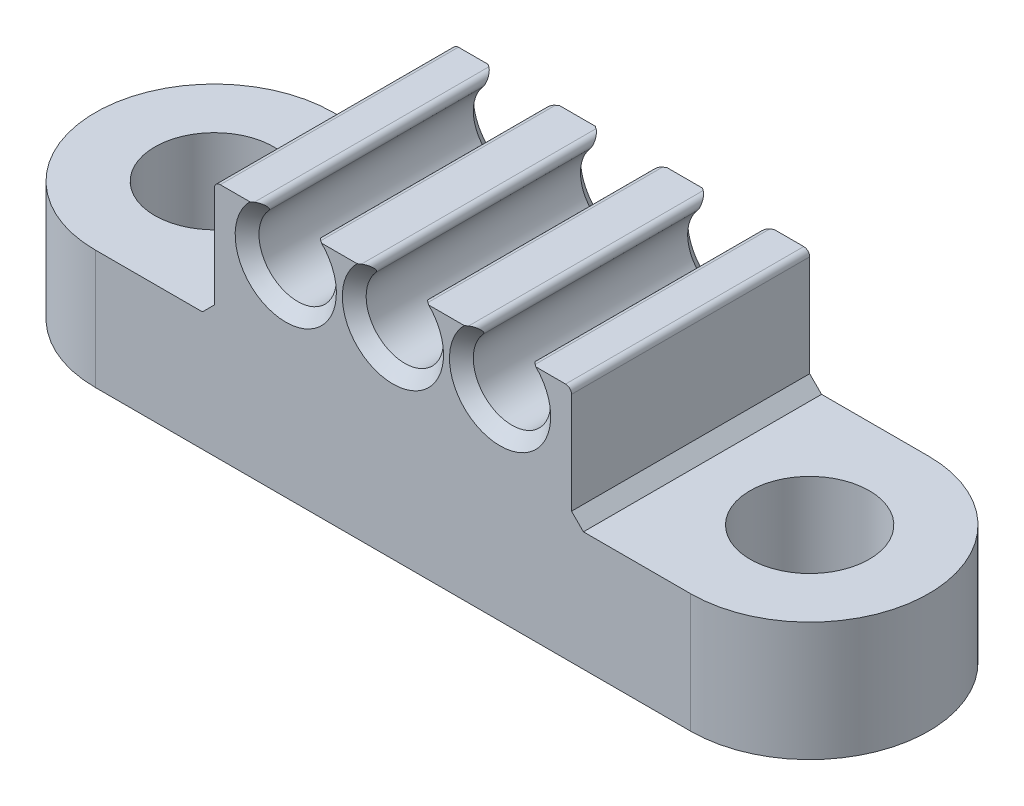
ISO-10303-21;
HEADER;
FILE_DESCRIPTION(('STEP AP214'),'2;1');
FILE_NAME('part.step','',(''),(''),'','','');
FILE_SCHEMA(('AUTOMOTIVE_DESIGN { 1 0 10303 214 1 1 1 1 }'));
ENDSEC;
DATA;
#1=APPLICATION_CONTEXT('core data for automotive mechanical design processes');
#2=APPLICATION_PROTOCOL_DEFINITION('international standard','automotive_design',2000,#1);
#3=PRODUCT_CONTEXT('',#1,'mechanical');
#4=PRODUCT('Part','Part','',(#3));
#5=PRODUCT_RELATED_PRODUCT_CATEGORY('part','',(#4));
#6=PRODUCT_DEFINITION_FORMATION('','',#4);
#7=PRODUCT_DEFINITION_CONTEXT('part definition',#1,'design');
#8=PRODUCT_DEFINITION('design','',#6,#7);
#9=PRODUCT_DEFINITION_SHAPE('','',#8);
#10=(LENGTH_UNIT() NAMED_UNIT(*) SI_UNIT(.MILLI.,.METRE.));
#11=(NAMED_UNIT(*) PLANE_ANGLE_UNIT() SI_UNIT($,.RADIAN.));
#12=(NAMED_UNIT(*) SI_UNIT($,.STERADIAN.) SOLID_ANGLE_UNIT());
#13=UNCERTAINTY_MEASURE_WITH_UNIT(LENGTH_MEASURE(1.E-05),#10,'distance_accuracy_value','');
#14=(GEOMETRIC_REPRESENTATION_CONTEXT(3) GLOBAL_UNCERTAINTY_ASSIGNED_CONTEXT((#13)) GLOBAL_UNIT_ASSIGNED_CONTEXT((#10,
#11,#12)) REPRESENTATION_CONTEXT('',''));
#15=CARTESIAN_POINT('',(0.,0.,0.));
#16=DIRECTION('',(0.,0.,1.));
#17=DIRECTION('',(1.,0.,0.));
#18=AXIS2_PLACEMENT_3D('',#15,#16,#17);
#19=CARTESIAN_POINT('',(-25.,10.,-10.));
#20=DIRECTION('',(0.,0.,1.));
#21=DIRECTION('',(1.,0.,0.));
#22=AXIS2_PLACEMENT_3D('',#19,#20,#21);
#23=PLANE('',#22);
#24=DIRECTION('',(-1.,0.,0.));
#25=VECTOR('',#24,1.);
#26=CARTESIAN_POINT('',(-15.,20.,-10.));
#27=LINE('',#26,#25);
#28=CARTESIAN_POINT('',(14.5,20.,-10.));
#29=VERTEX_POINT('',#28);
#30=CARTESIAN_POINT('',(12.0103986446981,20.,-10.));
#31=VERTEX_POINT('',#30);
#32=EDGE_CURVE('E826',#29,#31,#27,.T.);
#33=ORIENTED_EDGE('',*,*,#32,.F.);
#34=CARTESIAN_POINT('',(14.5,19.5,-10.));
#35=DIRECTION('',(0.,0.,1.));
#36=DIRECTION('',(1.,0.,0.));
#37=AXIS2_PLACEMENT_3D('',#34,#35,#36);
#38=CIRCLE('',#37,0.5);
#39=CARTESIAN_POINT('',(15.,19.5,-10.));
#40=VERTEX_POINT('',#39);
#41=EDGE_CURVE('E620',#29,#40,#38,.F.);
#42=ORIENTED_EDGE('',*,*,#41,.T.);
#43=DIRECTION('',(0.,-1.,0.));
#44=VECTOR('',#43,1.);
#45=CARTESIAN_POINT('',(15.,20.,-10.));
#46=LINE('',#45,#44);
#47=CARTESIAN_POINT('',(15.,11.,-10.));
#48=VERTEX_POINT('',#47);
#49=EDGE_CURVE('E762',#40,#48,#46,.T.);
#50=ORIENTED_EDGE('',*,*,#49,.T.);
#51=DIRECTION('',(-0.707106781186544,0.707106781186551,0.));
#52=VECTOR('',#51,1.);
#53=CARTESIAN_POINT('',(-4.49999999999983,30.5,-10.));
#54=LINE('',#53,#52);
#55=CARTESIAN_POINT('',(16.,10.,-10.));
#56=VERTEX_POINT('',#55);
#57=EDGE_CURVE('E51',#48,#56,#54,.F.);
#58=ORIENTED_EDGE('',*,*,#57,.T.);
#59=DIRECTION('',(-1.,0.,0.));
#60=VECTOR('',#59,1.);
#61=CARTESIAN_POINT('',(-25.,10.,-10.));
#62=LINE('',#61,#60);
#63=CARTESIAN_POINT('',(25.,10.,-10.));
#64=VERTEX_POINT('',#63);
#65=EDGE_CURVE('E236',#64,#56,#62,.T.);
#66=ORIENTED_EDGE('',*,*,#65,.F.);
#67=DIRECTION('',(0.,-1.,0.));
#68=VECTOR('',#67,1.);
#69=CARTESIAN_POINT('',(25.,10.,-10.));
#70=LINE('',#69,#68);
#71=CARTESIAN_POINT('',(25.,0.,-10.));
#72=VERTEX_POINT('',#71);
#73=EDGE_CURVE('E240',#64,#72,#70,.T.);
#74=ORIENTED_EDGE('',*,*,#73,.T.);
#75=DIRECTION('',(-1.,0.,0.));
#76=VECTOR('',#75,1.);
#77=CARTESIAN_POINT('',(-25.,0.,-10.));
#78=LINE('',#77,#76);
#79=CARTESIAN_POINT('',(-25.,0.,-10.));
#80=VERTEX_POINT('',#79);
#81=EDGE_CURVE('E784',#72,#80,#78,.T.);
#82=ORIENTED_EDGE('',*,*,#81,.T.);
#83=DIRECTION('',(0.,-1.,0.));
#84=VECTOR('',#83,1.);
#85=CARTESIAN_POINT('',(-25.,10.,-10.));
#86=LINE('',#85,#84);
#87=CARTESIAN_POINT('',(-25.,10.,-10.));
#88=VERTEX_POINT('',#87);
#89=EDGE_CURVE('E261',#88,#80,#86,.T.);
#90=ORIENTED_EDGE('',*,*,#89,.F.);
#91=CARTESIAN_POINT('',(-16.,10.,-10.));
#92=VERTEX_POINT('',#91);
#93=EDGE_CURVE('E244',#92,#88,#62,.T.);
#94=ORIENTED_EDGE('',*,*,#93,.F.);
#95=DIRECTION('',(-0.707106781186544,-0.707106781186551,0.));
#96=VECTOR('',#95,1.);
#97=CARTESIAN_POINT('',(-20.5,5.5,-10.));
#98=LINE('',#97,#96);
#99=CARTESIAN_POINT('',(-15.,11.,-10.));
#100=VERTEX_POINT('',#99);
#101=EDGE_CURVE('E744',#92,#100,#98,.F.);
#102=ORIENTED_EDGE('',*,*,#101,.T.);
#103=DIRECTION('',(0.,-1.,0.));
#104=VECTOR('',#103,1.);
#105=CARTESIAN_POINT('',(-15.,20.,-10.));
#106=LINE('',#105,#104);
#107=CARTESIAN_POINT('',(-15.,19.5,-10.));
#108=VERTEX_POINT('',#107);
#109=EDGE_CURVE('E751',#108,#100,#106,.T.);
#110=ORIENTED_EDGE('',*,*,#109,.F.);
#111=CARTESIAN_POINT('',(-14.5,19.5,-10.));
#112=DIRECTION('',(0.,0.,1.));
#113=DIRECTION('',(1.,0.,0.));
#114=AXIS2_PLACEMENT_3D('',#111,#112,#113);
#115=CIRCLE('',#114,0.5);
#116=CARTESIAN_POINT('',(-14.5,20.,-10.));
#117=VERTEX_POINT('',#116);
#118=EDGE_CURVE('E615',#108,#117,#115,.F.);
#119=ORIENTED_EDGE('',*,*,#118,.T.);
#120=CARTESIAN_POINT('',(-12.0103986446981,20.,-10.));
#121=VERTEX_POINT('',#120);
#122=EDGE_CURVE('E830',#121,#117,#27,.T.);
#123=ORIENTED_EDGE('',*,*,#122,.F.);
#124=CARTESIAN_POINT('',(-9.,17.,-10.));
#125=DIRECTION('',(0.,0.,1.));
#126=DIRECTION('',(1.,0.,0.));
#127=AXIS2_PLACEMENT_3D('',#124,#125,#126);
#128=CIRCLE('',#127,4.24999999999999);
#129=CARTESIAN_POINT('',(-5.98960135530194,20.,-10.));
#130=VERTEX_POINT('',#129);
#131=EDGE_CURVE('E260',#121,#130,#128,.T.);
#132=ORIENTED_EDGE('',*,*,#131,.T.);
#133=CARTESIAN_POINT('',(-3.01039864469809,20.,-10.));
#134=VERTEX_POINT('',#133);
#135=EDGE_CURVE('E831',#134,#130,#27,.T.);
#136=ORIENTED_EDGE('',*,*,#135,.F.);
#137=CARTESIAN_POINT('',(0.,17.,-10.));
#138=DIRECTION('',(0.,0.,1.));
#139=DIRECTION('',(1.,0.,0.));
#140=AXIS2_PLACEMENT_3D('',#137,#138,#139);
#141=CIRCLE('',#140,4.25000000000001);
#142=CARTESIAN_POINT('',(3.01039864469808,20.,-10.));
#143=VERTEX_POINT('',#142);
#144=EDGE_CURVE('E265',#134,#143,#141,.T.);
#145=ORIENTED_EDGE('',*,*,#144,.T.);
#146=CARTESIAN_POINT('',(5.9896013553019,20.,-10.));
#147=VERTEX_POINT('',#146);
#148=EDGE_CURVE('E828',#147,#143,#27,.T.);
#149=ORIENTED_EDGE('',*,*,#148,.F.);
#150=CARTESIAN_POINT('',(9.,17.,-10.));
#151=DIRECTION('',(0.,0.,1.));
#152=DIRECTION('',(1.,0.,0.));
#153=AXIS2_PLACEMENT_3D('',#150,#151,#152);
#154=CIRCLE('',#153,4.25000000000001);
#155=EDGE_CURVE('E275',#147,#31,#154,.T.);
#156=ORIENTED_EDGE('',*,*,#155,.T.);
#157=EDGE_LOOP('',(#33,#42,#50,#58,#66,#74,#82,#90,#94,#102,#110,#119,#123,#132,#136,#145,#149,#156));
#158=FACE_BOUND('',#157,.T.);
#159=ADVANCED_FACE('F41',(#158),#23,.F.);
#160=CARTESIAN_POINT('',(-25.,10.,10.));
#161=DIRECTION('',(0.,0.,-1.));
#162=DIRECTION('',(-1.,0.,0.));
#163=AXIS2_PLACEMENT_3D('',#160,#161,#162);
#164=PLANE('',#163);
#165=DIRECTION('',(0.,-1.,0.));
#166=VECTOR('',#165,1.);
#167=CARTESIAN_POINT('',(15.,20.,10.));
#168=LINE('',#167,#166);
#169=CARTESIAN_POINT('',(15.,19.5,10.));
#170=VERTEX_POINT('',#169);
#171=CARTESIAN_POINT('',(15.,11.,10.));
#172=VERTEX_POINT('',#171);
#173=EDGE_CURVE('E711',#170,#172,#168,.T.);
#174=ORIENTED_EDGE('',*,*,#173,.F.);
#175=CARTESIAN_POINT('',(14.5,19.5,10.));
#176=DIRECTION('',(0.,0.,-1.));
#177=DIRECTION('',(-1.,0.,0.));
#178=AXIS2_PLACEMENT_3D('',#175,#176,#177);
#179=CIRCLE('',#178,0.5);
#180=CARTESIAN_POINT('',(14.5,20.,10.));
#181=VERTEX_POINT('',#180);
#182=EDGE_CURVE('E628',#170,#181,#179,.F.);
#183=ORIENTED_EDGE('',*,*,#182,.T.);
#184=DIRECTION('',(1.,0.,0.));
#185=VECTOR('',#184,1.);
#186=CARTESIAN_POINT('',(-15.,20.,10.));
#187=LINE('',#186,#185);
#188=CARTESIAN_POINT('',(12.0103986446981,20.,10.));
#189=VERTEX_POINT('',#188);
#190=EDGE_CURVE('E714',#189,#181,#187,.T.);
#191=ORIENTED_EDGE('',*,*,#190,.F.);
#192=CARTESIAN_POINT('',(9.,17.,10.));
#193=DIRECTION('',(0.,0.,-1.));
#194=DIRECTION('',(-1.,0.,0.));
#195=AXIS2_PLACEMENT_3D('',#192,#193,#194);
#196=CIRCLE('',#195,4.25000000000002);
#197=CARTESIAN_POINT('',(5.98960135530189,20.,10.));
#198=VERTEX_POINT('',#197);
#199=EDGE_CURVE('E671',#189,#198,#196,.T.);
#200=ORIENTED_EDGE('',*,*,#199,.T.);
#201=CARTESIAN_POINT('',(3.01039864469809,20.,10.));
#202=VERTEX_POINT('',#201);
#203=EDGE_CURVE('E648',#202,#198,#187,.T.);
#204=ORIENTED_EDGE('',*,*,#203,.F.);
#205=CARTESIAN_POINT('',(0.,17.,10.));
#206=DIRECTION('',(0.,0.,-1.));
#207=DIRECTION('',(-1.,0.,0.));
#208=AXIS2_PLACEMENT_3D('',#205,#206,#207);
#209=CIRCLE('',#208,4.25000000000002);
#210=CARTESIAN_POINT('',(-3.01039864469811,20.,10.));
#211=VERTEX_POINT('',#210);
#212=EDGE_CURVE('E662',#202,#211,#209,.T.);
#213=ORIENTED_EDGE('',*,*,#212,.T.);
#214=CARTESIAN_POINT('',(-5.98960135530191,20.,10.));
#215=VERTEX_POINT('',#214);
#216=EDGE_CURVE('E712',#215,#211,#187,.T.);
#217=ORIENTED_EDGE('',*,*,#216,.F.);
#218=CARTESIAN_POINT('',(-9.,17.,10.));
#219=DIRECTION('',(0.,0.,-1.));
#220=DIRECTION('',(-1.,0.,0.));
#221=AXIS2_PLACEMENT_3D('',#218,#219,#220);
#222=CIRCLE('',#221,4.25000000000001);
#223=CARTESIAN_POINT('',(-12.0103986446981,20.,10.));
#224=VERTEX_POINT('',#223);
#225=EDGE_CURVE('E667',#215,#224,#222,.T.);
#226=ORIENTED_EDGE('',*,*,#225,.T.);
#227=CARTESIAN_POINT('',(-14.5,20.,10.));
#228=VERTEX_POINT('',#227);
#229=EDGE_CURVE('E706',#228,#224,#187,.T.);
#230=ORIENTED_EDGE('',*,*,#229,.F.);
#231=CARTESIAN_POINT('',(-14.5,19.5,10.));
#232=DIRECTION('',(0.,0.,-1.));
#233=DIRECTION('',(-1.,0.,0.));
#234=AXIS2_PLACEMENT_3D('',#231,#232,#233);
#235=CIRCLE('',#234,0.5);
#236=CARTESIAN_POINT('',(-15.,19.5,10.));
#237=VERTEX_POINT('',#236);
#238=EDGE_CURVE('E626',#228,#237,#235,.F.);
#239=ORIENTED_EDGE('',*,*,#238,.T.);
#240=DIRECTION('',(0.,-1.,0.));
#241=VECTOR('',#240,1.);
#242=CARTESIAN_POINT('',(-15.,20.,10.));
#243=LINE('',#242,#241);
#244=CARTESIAN_POINT('',(-15.,11.,10.));
#245=VERTEX_POINT('',#244);
#246=EDGE_CURVE('E763',#237,#245,#243,.T.);
#247=ORIENTED_EDGE('',*,*,#246,.T.);
#248=DIRECTION('',(0.707106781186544,0.707106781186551,0.));
#249=VECTOR('',#248,1.);
#250=CARTESIAN_POINT('',(-20.5,5.5,10.));
#251=LINE('',#250,#249);
#252=CARTESIAN_POINT('',(-16.,10.,10.));
#253=VERTEX_POINT('',#252);
#254=EDGE_CURVE('E741',#245,#253,#251,.F.);
#255=ORIENTED_EDGE('',*,*,#254,.T.);
#256=DIRECTION('',(1.,0.,0.));
#257=VECTOR('',#256,1.);
#258=CARTESIAN_POINT('',(-25.,10.,10.));
#259=LINE('',#258,#257);
#260=CARTESIAN_POINT('',(-25.,10.,10.));
#261=VERTEX_POINT('',#260);
#262=EDGE_CURVE('E769',#261,#253,#259,.T.);
#263=ORIENTED_EDGE('',*,*,#262,.F.);
#264=DIRECTION('',(0.,-1.,0.));
#265=VECTOR('',#264,1.);
#266=CARTESIAN_POINT('',(-25.,10.,10.));
#267=LINE('',#266,#265);
#268=CARTESIAN_POINT('',(-25.,0.,10.));
#269=VERTEX_POINT('',#268);
#270=EDGE_CURVE('E268',#261,#269,#267,.T.);
#271=ORIENTED_EDGE('',*,*,#270,.T.);
#272=DIRECTION('',(1.,0.,0.));
#273=VECTOR('',#272,1.);
#274=CARTESIAN_POINT('',(-25.,0.,10.));
#275=LINE('',#274,#273);
#276=CARTESIAN_POINT('',(25.,0.,10.));
#277=VERTEX_POINT('',#276);
#278=EDGE_CURVE('E254',#269,#277,#275,.T.);
#279=ORIENTED_EDGE('',*,*,#278,.T.);
#280=DIRECTION('',(0.,-1.,0.));
#281=VECTOR('',#280,1.);
#282=CARTESIAN_POINT('',(25.,10.,10.));
#283=LINE('',#282,#281);
#284=CARTESIAN_POINT('',(25.,10.,10.));
#285=VERTEX_POINT('',#284);
#286=EDGE_CURVE('E775',#285,#277,#283,.T.);
#287=ORIENTED_EDGE('',*,*,#286,.F.);
#288=CARTESIAN_POINT('',(16.,10.,10.));
#289=VERTEX_POINT('',#288);
#290=EDGE_CURVE('E249',#289,#285,#259,.T.);
#291=ORIENTED_EDGE('',*,*,#290,.F.);
#292=DIRECTION('',(0.707106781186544,-0.707106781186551,0.));
#293=VECTOR('',#292,1.);
#294=CARTESIAN_POINT('',(-4.49999999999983,30.5,10.));
#295=LINE('',#294,#293);
#296=EDGE_CURVE('E11',#289,#172,#295,.F.);
#297=ORIENTED_EDGE('',*,*,#296,.T.);
#298=EDGE_LOOP('',(#174,#183,#191,#200,#204,#213,#217,#226,#230,#239,#247,#255,#263,#271,#279,
#287,#291,#297));
#299=FACE_BOUND('',#298,.T.);
#300=ADVANCED_FACE('F305',(#299),#164,.F.);
#301=CARTESIAN_POINT('',(0.,20.,0.));
#302=DIRECTION('',(0.,-1.,0.));
#303=DIRECTION('',(0.,0.,-1.));
#304=AXIS2_PLACEMENT_3D('',#301,#302,#303);
#305=PLANE('',#304);
#306=CARTESIAN_POINT('',(-3.0103986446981,20.,10.));
#307=CARTESIAN_POINT('',(-2.94132274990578,20.,9.95107652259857));
#308=CARTESIAN_POINT('',(-2.87185864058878,20.,9.90270589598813));
#309=CARTESIAN_POINT('',(-2.73203218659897,20.,9.8072631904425));
#310=CARTESIAN_POINT('',(-2.6616697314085,20.,9.76019127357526));
#311=CARTESIAN_POINT('',(-2.4496104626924,20.,9.6215790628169));
#312=CARTESIAN_POINT('',(-2.30642429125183,20.,9.53227168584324));
#313=CARTESIAN_POINT('',(-2.08784340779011,20.,9.40453284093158));
#314=CARTESIAN_POINT('',(-2.01428293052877,20.,9.36295633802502));
#315=CARTESIAN_POINT('',(-1.86580228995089,20.,9.28232611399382));
#316=CARTESIAN_POINT('',(-1.7908823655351,20.,9.24327195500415));
#317=CARTESIAN_POINT('',(-1.63927323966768,20.,9.16802078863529));
#318=CARTESIAN_POINT('',(-1.56257864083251,20.,9.13183457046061));
#319=CARTESIAN_POINT('',(-1.40753925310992,20.,9.06305903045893));
#320=CARTESIAN_POINT('',(-1.32919343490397,20.,9.03047203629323));
#321=CARTESIAN_POINT('',(-1.25,20.,8.99999999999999));
#322=B_SPLINE_CURVE_WITH_KNOTS('',3,(#306,#307,#308,#309,#310,#311,#312,#313,#314,#315,#316,
#317,#318,#319,#320,#321),.UNSPECIFIED.,.F.,.F.,(4,2,2,2,2,2,2,4),(0.,0.253928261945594,
0.507888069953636,1.01389933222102,1.26735255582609,1.52076166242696,1.77508282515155,
2.02956750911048),.UNSPECIFIED.);
#323=CARTESIAN_POINT('',(-2.79508497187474,20.,9.85030486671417));
#324=VERTEX_POINT('',#323);
#325=EDGE_CURVE('E367',#211,#324,#322,.T.);
#326=ORIENTED_EDGE('',*,*,#325,.T.);
#327=DIRECTION('',(0.,0.,1.));
#328=VECTOR('',#327,1.);
#329=CARTESIAN_POINT('',(-2.79508497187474,20.,0.));
#330=LINE('',#329,#328);
#331=CARTESIAN_POINT('',(-2.79508497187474,20.,-9.85030486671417));
#332=VERTEX_POINT('',#331);
#333=EDGE_CURVE('E460',#324,#332,#330,.F.);
#334=ORIENTED_EDGE('',*,*,#333,.T.);
#335=CARTESIAN_POINT('',(-1.25,20.,-8.99999999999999));
#336=CARTESIAN_POINT('',(-1.32919343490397,20.,-9.03047203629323));
#337=CARTESIAN_POINT('',(-1.40753925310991,20.,-9.06305903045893));
#338=CARTESIAN_POINT('',(-1.5625786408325,20.,-9.13183457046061));
#339=CARTESIAN_POINT('',(-1.63927323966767,20.,-9.16802078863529));
#340=CARTESIAN_POINT('',(-1.79088236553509,20.,-9.24327195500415));
#341=CARTESIAN_POINT('',(-1.86580228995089,20.,-9.28232611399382));
#342=CARTESIAN_POINT('',(-2.01428293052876,20.,-9.36295633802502));
#343=CARTESIAN_POINT('',(-2.08784340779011,20.,-9.40453284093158));
#344=CARTESIAN_POINT('',(-2.30642429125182,20.,-9.53227168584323));
#345=CARTESIAN_POINT('',(-2.44961046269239,20.,-9.6215790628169));
#346=CARTESIAN_POINT('',(-2.66166973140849,20.,-9.76019127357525));
#347=CARTESIAN_POINT('',(-2.73203218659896,20.,-9.80726319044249));
#348=CARTESIAN_POINT('',(-2.87185864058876,20.,-9.90270589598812));
#349=CARTESIAN_POINT('',(-2.94132274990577,20.,-9.95107652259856));
#350=CARTESIAN_POINT('',(-3.01039864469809,20.,-10.));
#351=B_SPLINE_CURVE_WITH_KNOTS('',3,(#335,#336,#337,#338,#339,#340,#341,#342,#343,#344,#345,
#346,#347,#348,#349,#350),.UNSPECIFIED.,.F.,.F.,(4,2,2,2,2,2,2,4),(0.,0.254484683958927,
0.508805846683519,0.762214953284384,1.01566817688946,1.52167943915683,1.77563924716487,
2.02956750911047),.UNSPECIFIED.);
#352=EDGE_CURVE('E373',#332,#134,#351,.T.);
#353=ORIENTED_EDGE('',*,*,#352,.T.);
#354=ORIENTED_EDGE('',*,*,#135,.T.);
#355=CARTESIAN_POINT('',(-5.98960135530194,20.,-10.));
#356=CARTESIAN_POINT('',(-6.05867725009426,20.,-9.95107652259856));
#357=CARTESIAN_POINT('',(-6.12814135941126,20.,-9.90270589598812));
#358=CARTESIAN_POINT('',(-6.26796781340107,20.,-9.80726319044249));
#359=CARTESIAN_POINT('',(-6.33833026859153,20.,-9.76019127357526));
#360=CARTESIAN_POINT('',(-6.55038953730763,20.,-9.62157906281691));
#361=CARTESIAN_POINT('',(-6.6935757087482,20.,-9.53227168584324));
#362=CARTESIAN_POINT('',(-6.91215659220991,20.,-9.40453284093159));
#363=CARTESIAN_POINT('',(-6.98571706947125,20.,-9.36295633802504));
#364=CARTESIAN_POINT('',(-7.13419771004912,20.,-9.28232611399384));
#365=CARTESIAN_POINT('',(-7.20911763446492,20.,-9.24327195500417));
#366=CARTESIAN_POINT('',(-7.36072676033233,20.,-9.16802078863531));
#367=CARTESIAN_POINT('',(-7.4374213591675,20.,-9.13183457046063));
#368=CARTESIAN_POINT('',(-7.59246074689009,20.,-9.06305903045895));
#369=CARTESIAN_POINT('',(-7.67080656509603,20.,-9.03047203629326));
#370=CARTESIAN_POINT('',(-7.75,20.,-9.00000000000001));
#371=B_SPLINE_CURVE_WITH_KNOTS('',3,(#355,#356,#357,#358,#359,#360,#361,#362,#363,#364,#365,
#366,#367,#368,#369,#370),.UNSPECIFIED.,.F.,.F.,(4,2,2,2,2,2,2,4),(0.,0.25392826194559,
0.507888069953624,1.01389933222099,1.26735255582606,1.52076166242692,1.77508282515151,
2.02956750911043),.UNSPECIFIED.);
#372=CARTESIAN_POINT('',(-6.20491502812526,20.,-9.8503048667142));
#373=VERTEX_POINT('',#372);
#374=EDGE_CURVE('E359',#130,#373,#371,.T.);
#375=ORIENTED_EDGE('',*,*,#374,.T.);
#376=DIRECTION('',(0.,0.,-1.));
#377=VECTOR('',#376,1.);
#378=CARTESIAN_POINT('',(-6.20491502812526,20.,9.));
#379=LINE('',#378,#377);
#380=CARTESIAN_POINT('',(-6.20491502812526,20.,9.85030486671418));
#381=VERTEX_POINT('',#380);
#382=EDGE_CURVE('E464',#373,#381,#379,.F.);
#383=ORIENTED_EDGE('',*,*,#382,.T.);
#384=CARTESIAN_POINT('',(-7.75,20.,9.));
#385=CARTESIAN_POINT('',(-7.67080656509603,20.,9.03047203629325));
#386=CARTESIAN_POINT('',(-7.59246074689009,20.,9.06305903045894));
#387=CARTESIAN_POINT('',(-7.4374213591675,20.,9.13183457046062));
#388=CARTESIAN_POINT('',(-7.36072676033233,20.,9.1680207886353));
#389=CARTESIAN_POINT('',(-7.20911763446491,20.,9.24327195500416));
#390=CARTESIAN_POINT('',(-7.13419771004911,20.,9.28232611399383));
#391=CARTESIAN_POINT('',(-6.98571706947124,20.,9.36295633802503));
#392=CARTESIAN_POINT('',(-6.91215659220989,20.,9.40453284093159));
#393=CARTESIAN_POINT('',(-6.69357570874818,20.,9.53227168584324));
#394=CARTESIAN_POINT('',(-6.55038953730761,20.,9.62157906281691));
#395=CARTESIAN_POINT('',(-6.3383302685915,20.,9.76019127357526));
#396=CARTESIAN_POINT('',(-6.26796781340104,20.,9.8072631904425));
#397=CARTESIAN_POINT('',(-6.12814135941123,20.,9.90270589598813));
#398=CARTESIAN_POINT('',(-6.05867725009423,20.,9.95107652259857));
#399=CARTESIAN_POINT('',(-5.98960135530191,20.,10.));
#400=B_SPLINE_CURVE_WITH_KNOTS('',3,(#384,#385,#386,#387,#388,#389,#390,#391,#392,#393,#394,
#395,#396,#397,#398,#399),.UNSPECIFIED.,.F.,.F.,(4,2,2,2,2,2,2,4),(0.,0.254484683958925,
0.508805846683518,0.762214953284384,1.01566817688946,1.52167943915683,1.77563924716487,
2.02956750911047),.UNSPECIFIED.);
#401=EDGE_CURVE('E350',#381,#215,#400,.T.);
#402=ORIENTED_EDGE('',*,*,#401,.T.);
#403=ORIENTED_EDGE('',*,*,#216,.T.);
#404=EDGE_LOOP('',(#326,#334,#353,#354,#375,#383,#402,#403));
#405=FACE_BOUND('',#404,.T.);
#406=ADVANCED_FACE('F299',(#405),#305,.F.);
#407=CARTESIAN_POINT('',(-12.0103986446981,20.,10.));
#408=CARTESIAN_POINT('',(-11.9413227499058,20.,9.95107652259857));
#409=CARTESIAN_POINT('',(-11.8718586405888,20.,9.90270589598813));
#410=CARTESIAN_POINT('',(-11.732032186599,20.,9.8072631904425));
#411=CARTESIAN_POINT('',(-11.6616697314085,20.,9.76019127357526));
#412=CARTESIAN_POINT('',(-11.4496104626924,20.,9.62157906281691));
#413=CARTESIAN_POINT('',(-11.3064242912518,20.,9.53227168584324));
#414=CARTESIAN_POINT('',(-11.0878434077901,20.,9.40453284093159));
#415=CARTESIAN_POINT('',(-11.0142829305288,20.,9.36295633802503));
#416=CARTESIAN_POINT('',(-10.8658022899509,20.,9.28232611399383));
#417=CARTESIAN_POINT('',(-10.7908823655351,20.,9.24327195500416));
#418=CARTESIAN_POINT('',(-10.6392732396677,20.,9.1680207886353));
#419=CARTESIAN_POINT('',(-10.5625786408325,20.,9.13183457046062));
#420=CARTESIAN_POINT('',(-10.4075392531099,20.,9.06305903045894));
#421=CARTESIAN_POINT('',(-10.329193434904,20.,9.03047203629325));
#422=CARTESIAN_POINT('',(-10.25,20.,9.));
#423=B_SPLINE_CURVE_WITH_KNOTS('',3,(#407,#408,#409,#410,#411,#412,#413,#414,#415,#416,#417,
#418,#419,#420,#421,#422),.UNSPECIFIED.,.F.,.F.,(4,2,2,2,2,2,2,4),(0.,0.253928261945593,
0.507888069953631,1.01389933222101,1.26735255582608,1.52076166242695,1.77508282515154,
2.02956750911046),.UNSPECIFIED.);
#424=CARTESIAN_POINT('',(-11.7950849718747,20.,9.85030486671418));
#425=VERTEX_POINT('',#424);
#426=EDGE_CURVE('E380',#224,#425,#423,.T.);
#427=ORIENTED_EDGE('',*,*,#426,.T.);
#428=DIRECTION('',(0.,0.,-1.));
#429=VECTOR('',#428,1.);
#430=CARTESIAN_POINT('',(-11.7950849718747,20.,-9.00000000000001));
#431=LINE('',#430,#429);
#432=CARTESIAN_POINT('',(-11.7950849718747,20.,-9.85030486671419));
#433=VERTEX_POINT('',#432);
#434=EDGE_CURVE('E698',#425,#433,#431,.T.);
#435=ORIENTED_EDGE('',*,*,#434,.T.);
#436=CARTESIAN_POINT('',(-10.25,20.,-9.00000000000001));
#437=CARTESIAN_POINT('',(-10.329193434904,20.,-9.03047203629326));
#438=CARTESIAN_POINT('',(-10.4075392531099,20.,-9.06305903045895));
#439=CARTESIAN_POINT('',(-10.5625786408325,20.,-9.13183457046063));
#440=CARTESIAN_POINT('',(-10.6392732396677,20.,-9.16802078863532));
#441=CARTESIAN_POINT('',(-10.7908823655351,20.,-9.24327195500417));
#442=CARTESIAN_POINT('',(-10.8658022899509,20.,-9.28232611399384));
#443=CARTESIAN_POINT('',(-11.0142829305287,20.,-9.36295633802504));
#444=CARTESIAN_POINT('',(-11.0878434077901,20.,-9.40453284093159));
#445=CARTESIAN_POINT('',(-11.3064242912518,20.,-9.53227168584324));
#446=CARTESIAN_POINT('',(-11.4496104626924,20.,-9.62157906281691));
#447=CARTESIAN_POINT('',(-11.6616697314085,20.,-9.76019127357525));
#448=CARTESIAN_POINT('',(-11.7320321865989,20.,-9.80726319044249));
#449=CARTESIAN_POINT('',(-11.8718586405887,20.,-9.90270589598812));
#450=CARTESIAN_POINT('',(-11.9413227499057,20.,-9.95107652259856));
#451=CARTESIAN_POINT('',(-12.0103986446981,20.,-10.));
#452=B_SPLINE_CURVE_WITH_KNOTS('',3,(#436,#437,#438,#439,#440,#441,#442,#443,#444,#445,#446,
#447,#448,#449,#450,#451),.UNSPECIFIED.,.F.,.F.,(4,2,2,2,2,2,2,4),(0.,0.254484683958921,
0.508805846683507,0.762214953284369,1.01566817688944,1.5216794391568,1.77563924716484,
2.02956750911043),.UNSPECIFIED.);
#453=EDGE_CURVE('E388',#433,#121,#452,.T.);
#454=ORIENTED_EDGE('',*,*,#453,.T.);
#455=ORIENTED_EDGE('',*,*,#122,.T.);
#456=DIRECTION('',(0.,0.,1.));
#457=VECTOR('',#456,1.);
#458=CARTESIAN_POINT('',(-14.5,20.,0.));
#459=LINE('',#458,#457);
#460=EDGE_CURVE('E709',#117,#228,#459,.T.);
#461=ORIENTED_EDGE('',*,*,#460,.T.);
#462=ORIENTED_EDGE('',*,*,#229,.T.);
#463=EDGE_LOOP('',(#427,#435,#454,#455,#461,#462));
#464=FACE_BOUND('',#463,.T.);
#465=ADVANCED_FACE('F304',(#464),#305,.F.);
#466=CARTESIAN_POINT('',(5.9896013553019,20.,10.));
#467=CARTESIAN_POINT('',(6.05867725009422,20.,9.95107652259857));
#468=CARTESIAN_POINT('',(6.12814135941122,20.,9.90270589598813));
#469=CARTESIAN_POINT('',(6.26796781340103,20.,9.8072631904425));
#470=CARTESIAN_POINT('',(6.3383302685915,20.,9.76019127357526));
#471=CARTESIAN_POINT('',(6.5503895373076,20.,9.6215790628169));
#472=CARTESIAN_POINT('',(6.69357570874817,20.,9.53227168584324));
#473=CARTESIAN_POINT('',(6.91215659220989,20.,9.40453284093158));
#474=CARTESIAN_POINT('',(6.98571706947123,20.,9.36295633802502));
#475=CARTESIAN_POINT('',(7.13419771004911,20.,9.28232611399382));
#476=CARTESIAN_POINT('',(7.2091176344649,20.,9.24327195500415));
#477=CARTESIAN_POINT('',(7.36072676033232,20.,9.16802078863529));
#478=CARTESIAN_POINT('',(7.43742135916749,20.,9.13183457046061));
#479=CARTESIAN_POINT('',(7.59246074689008,20.,9.06305903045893));
#480=CARTESIAN_POINT('',(7.67080656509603,20.,9.03047203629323));
#481=CARTESIAN_POINT('',(7.75,20.,8.99999999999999));
#482=B_SPLINE_CURVE_WITH_KNOTS('',3,(#466,#467,#468,#469,#470,#471,#472,#473,#474,#475,#476,
#477,#478,#479,#480,#481),.UNSPECIFIED.,.F.,.F.,(4,2,2,2,2,2,2,4),(0.,0.253928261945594,
0.507888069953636,1.01389933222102,1.26735255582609,1.52076166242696,1.77508282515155,
2.02956750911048),.UNSPECIFIED.);
#483=CARTESIAN_POINT('',(6.20491502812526,20.,9.85030486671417));
#484=VERTEX_POINT('',#483);
#485=EDGE_CURVE('E335',#198,#484,#482,.T.);
#486=ORIENTED_EDGE('',*,*,#485,.T.);
#487=DIRECTION('',(0.,0.,1.));
#488=VECTOR('',#487,1.);
#489=CARTESIAN_POINT('',(6.20491502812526,20.,0.));
#490=LINE('',#489,#488);
#491=CARTESIAN_POINT('',(6.20491502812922,20.,-9.85030486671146));
#492=VERTEX_POINT('',#491);
#493=EDGE_CURVE('E646',#484,#492,#490,.F.);
#494=ORIENTED_EDGE('',*,*,#493,.T.);
#495=CARTESIAN_POINT('',(7.75,20.,-8.99999999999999));
#496=CARTESIAN_POINT('',(7.67080656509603,20.,-9.03047203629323));
#497=CARTESIAN_POINT('',(7.59246074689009,20.,-9.06305903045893));
#498=CARTESIAN_POINT('',(7.4374213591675,20.,-9.13183457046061));
#499=CARTESIAN_POINT('',(7.36072676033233,20.,-9.16802078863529));
#500=CARTESIAN_POINT('',(7.20911763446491,20.,-9.24327195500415));
#501=CARTESIAN_POINT('',(7.13419771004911,20.,-9.28232611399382));
#502=CARTESIAN_POINT('',(6.98571706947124,20.,-9.36295633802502));
#503=CARTESIAN_POINT('',(6.91215659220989,20.,-9.40453284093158));
#504=CARTESIAN_POINT('',(6.69357570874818,20.,-9.53227168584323));
#505=CARTESIAN_POINT('',(6.55038953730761,20.,-9.6215790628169));
#506=CARTESIAN_POINT('',(6.33833026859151,20.,-9.76019127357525));
#507=CARTESIAN_POINT('',(6.26796781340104,20.,-9.80726319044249));
#508=CARTESIAN_POINT('',(6.12814135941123,20.,-9.90270589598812));
#509=CARTESIAN_POINT('',(6.05867725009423,20.,-9.95107652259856));
#510=CARTESIAN_POINT('',(5.98960135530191,20.,-10.));
#511=B_SPLINE_CURVE_WITH_KNOTS('',3,(#495,#496,#497,#498,#499,#500,#501,#502,#503,#504,#505,
#506,#507,#508,#509,#510),.UNSPECIFIED.,.F.,.F.,(4,2,2,2,2,2,2,4),(0.,0.254484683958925,
0.508805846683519,0.762214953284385,1.01566817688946,1.52167943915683,1.77563924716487,
2.02956750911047),.UNSPECIFIED.);
#512=EDGE_CURVE('E342',#492,#147,#511,.T.);
#513=ORIENTED_EDGE('',*,*,#512,.T.);
#514=ORIENTED_EDGE('',*,*,#148,.T.);
#515=CARTESIAN_POINT('',(3.01039864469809,20.,-10.));
#516=CARTESIAN_POINT('',(2.94132274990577,20.,-9.95107652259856));
#517=CARTESIAN_POINT('',(2.87185864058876,20.,-9.90270589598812));
#518=CARTESIAN_POINT('',(2.73203218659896,20.,-9.80726319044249));
#519=CARTESIAN_POINT('',(2.66166973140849,20.,-9.76019127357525));
#520=CARTESIAN_POINT('',(2.44961046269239,20.,-9.6215790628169));
#521=CARTESIAN_POINT('',(2.30642429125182,20.,-9.53227168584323));
#522=CARTESIAN_POINT('',(2.08784340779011,20.,-9.40453284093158));
#523=CARTESIAN_POINT('',(2.01428293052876,20.,-9.36295633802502));
#524=CARTESIAN_POINT('',(1.86580228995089,20.,-9.28232611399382));
#525=CARTESIAN_POINT('',(1.79088236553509,20.,-9.24327195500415));
#526=CARTESIAN_POINT('',(1.63927323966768,20.,-9.16802078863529));
#527=CARTESIAN_POINT('',(1.5625786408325,20.,-9.13183457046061));
#528=CARTESIAN_POINT('',(1.40753925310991,20.,-9.06305903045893));
#529=CARTESIAN_POINT('',(1.32919343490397,20.,-9.03047203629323));
#530=CARTESIAN_POINT('',(1.25,20.,-8.99999999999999));
#531=B_SPLINE_CURVE_WITH_KNOTS('',3,(#515,#516,#517,#518,#519,#520,#521,#522,#523,#524,#525,
#526,#527,#528,#529,#530),.UNSPECIFIED.,.F.,.F.,(4,2,2,2,2,2,2,4),(0.,0.253928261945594,
0.507888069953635,1.01389933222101,1.26735255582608,1.52076166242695,1.77508282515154,
2.02956750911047),.UNSPECIFIED.);
#532=CARTESIAN_POINT('',(2.79508497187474,20.,-9.85030486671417));
#533=VERTEX_POINT('',#532);
#534=EDGE_CURVE('E328',#143,#533,#531,.T.);
#535=ORIENTED_EDGE('',*,*,#534,.T.);
#536=DIRECTION('',(0.,0.,1.));
#537=VECTOR('',#536,1.);
#538=CARTESIAN_POINT('',(2.79508497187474,20.,0.));
#539=LINE('',#538,#537);
#540=CARTESIAN_POINT('',(2.79508497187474,20.,9.85030486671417));
#541=VERTEX_POINT('',#540);
#542=EDGE_CURVE('E568',#533,#541,#539,.T.);
#543=ORIENTED_EDGE('',*,*,#542,.T.);
#544=CARTESIAN_POINT('',(1.25,20.,8.99999999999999));
#545=CARTESIAN_POINT('',(1.32919343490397,20.,9.03047203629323));
#546=CARTESIAN_POINT('',(1.40753925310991,20.,9.06305903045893));
#547=CARTESIAN_POINT('',(1.56257864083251,20.,9.13183457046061));
#548=CARTESIAN_POINT('',(1.63927323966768,20.,9.16802078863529));
#549=CARTESIAN_POINT('',(1.7908823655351,20.,9.24327195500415));
#550=CARTESIAN_POINT('',(1.86580228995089,20.,9.28232611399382));
#551=CARTESIAN_POINT('',(2.01428293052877,20.,9.36295633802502));
#552=CARTESIAN_POINT('',(2.08784340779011,20.,9.40453284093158));
#553=CARTESIAN_POINT('',(2.30642429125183,20.,9.53227168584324));
#554=CARTESIAN_POINT('',(2.4496104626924,20.,9.6215790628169));
#555=CARTESIAN_POINT('',(2.6616697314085,20.,9.76019127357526));
#556=CARTESIAN_POINT('',(2.73203218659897,20.,9.8072631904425));
#557=CARTESIAN_POINT('',(2.87185864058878,20.,9.90270589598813));
#558=CARTESIAN_POINT('',(2.94132274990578,20.,9.95107652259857));
#559=CARTESIAN_POINT('',(3.0103986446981,20.,10.));
#560=B_SPLINE_CURVE_WITH_KNOTS('',3,(#544,#545,#546,#547,#548,#549,#550,#551,#552,#553,#554,
#555,#556,#557,#558,#559),.UNSPECIFIED.,.F.,.F.,(4,2,2,2,2,2,2,4),(0.,0.254484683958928,
0.508805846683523,0.762214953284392,1.01566817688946,1.52167943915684,1.77563924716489,
2.02956750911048),.UNSPECIFIED.);
#561=EDGE_CURVE('E319',#541,#202,#560,.T.);
#562=ORIENTED_EDGE('',*,*,#561,.T.);
#563=ORIENTED_EDGE('',*,*,#203,.T.);
#564=EDGE_LOOP('',(#486,#494,#513,#514,#535,#543,#562,#563));
#565=FACE_BOUND('',#564,.T.);
#566=ADVANCED_FACE('F645',(#565),#305,.F.);
#567=ORIENTED_EDGE('',*,*,#190,.T.);
#568=DIRECTION('',(0.,0.,-1.));
#569=VECTOR('',#568,1.);
#570=CARTESIAN_POINT('',(14.5,20.,0.));
#571=LINE('',#570,#569);
#572=EDGE_CURVE('E611',#181,#29,#571,.T.);
#573=ORIENTED_EDGE('',*,*,#572,.T.);
#574=ORIENTED_EDGE('',*,*,#32,.T.);
#575=CARTESIAN_POINT('',(12.0103986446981,20.,-10.));
#576=CARTESIAN_POINT('',(11.9413227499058,20.,-9.95107652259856));
#577=CARTESIAN_POINT('',(11.8718586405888,20.,-9.90270589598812));
#578=CARTESIAN_POINT('',(11.732032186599,20.,-9.80726319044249));
#579=CARTESIAN_POINT('',(11.6616697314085,20.,-9.76019127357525));
#580=CARTESIAN_POINT('',(11.4496104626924,20.,-9.6215790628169));
#581=CARTESIAN_POINT('',(11.3064242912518,20.,-9.53227168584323));
#582=CARTESIAN_POINT('',(11.0878434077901,20.,-9.40453284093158));
#583=CARTESIAN_POINT('',(11.0142829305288,20.,-9.36295633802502));
#584=CARTESIAN_POINT('',(10.8658022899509,20.,-9.28232611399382));
#585=CARTESIAN_POINT('',(10.7908823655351,20.,-9.24327195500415));
#586=CARTESIAN_POINT('',(10.6392732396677,20.,-9.16802078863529));
#587=CARTESIAN_POINT('',(10.5625786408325,20.,-9.13183457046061));
#588=CARTESIAN_POINT('',(10.4075392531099,20.,-9.06305903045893));
#589=CARTESIAN_POINT('',(10.329193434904,20.,-9.03047203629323));
#590=CARTESIAN_POINT('',(10.25,20.,-8.99999999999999));
#591=B_SPLINE_CURVE_WITH_KNOTS('',3,(#575,#576,#577,#578,#579,#580,#581,#582,#583,#584,#585,
#586,#587,#588,#589,#590),.UNSPECIFIED.,.F.,.F.,(4,2,2,2,2,2,2,4),(0.,0.253928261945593,
0.507888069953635,1.01389933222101,1.26735255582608,1.52076166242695,1.77508282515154,
2.02956750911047),.UNSPECIFIED.);
#592=CARTESIAN_POINT('',(11.7950849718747,20.,-9.85030486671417));
#593=VERTEX_POINT('',#592);
#594=EDGE_CURVE('E288',#31,#593,#591,.T.);
#595=ORIENTED_EDGE('',*,*,#594,.T.);
#596=DIRECTION('',(0.,0.,1.));
#597=VECTOR('',#596,1.);
#598=CARTESIAN_POINT('',(11.7950849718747,20.,0.));
#599=LINE('',#598,#597);
#600=CARTESIAN_POINT('',(11.7950849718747,20.,9.85030486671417));
#601=VERTEX_POINT('',#600);
#602=EDGE_CURVE('E607',#593,#601,#599,.T.);
#603=ORIENTED_EDGE('',*,*,#602,.T.);
#604=CARTESIAN_POINT('',(10.25,20.,8.99999999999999));
#605=CARTESIAN_POINT('',(10.329193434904,20.,9.03047203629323));
#606=CARTESIAN_POINT('',(10.4075392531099,20.,9.06305903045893));
#607=CARTESIAN_POINT('',(10.5625786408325,20.,9.13183457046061));
#608=CARTESIAN_POINT('',(10.6392732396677,20.,9.16802078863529));
#609=CARTESIAN_POINT('',(10.7908823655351,20.,9.24327195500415));
#610=CARTESIAN_POINT('',(10.8658022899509,20.,9.28232611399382));
#611=CARTESIAN_POINT('',(11.0142829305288,20.,9.36295633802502));
#612=CARTESIAN_POINT('',(11.0878434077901,20.,9.40453284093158));
#613=CARTESIAN_POINT('',(11.3064242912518,20.,9.53227168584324));
#614=CARTESIAN_POINT('',(11.4496104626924,20.,9.6215790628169));
#615=CARTESIAN_POINT('',(11.6616697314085,20.,9.76019127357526));
#616=CARTESIAN_POINT('',(11.732032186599,20.,9.8072631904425));
#617=CARTESIAN_POINT('',(11.8718586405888,20.,9.90270589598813));
#618=CARTESIAN_POINT('',(11.9413227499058,20.,9.95107652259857));
#619=CARTESIAN_POINT('',(12.0103986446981,20.,10.));
#620=B_SPLINE_CURVE_WITH_KNOTS('',3,(#604,#605,#606,#607,#608,#609,#610,#611,#612,#613,#614,
#615,#616,#617,#618,#619),.UNSPECIFIED.,.F.,.F.,(4,2,2,2,2,2,2,4),(0.,0.254484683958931,
0.508805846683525,0.762214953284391,1.01566817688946,1.52167943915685,1.77563924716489,
2.02956750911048),.UNSPECIFIED.);
#621=EDGE_CURVE('E279',#601,#189,#620,.T.);
#622=ORIENTED_EDGE('',*,*,#621,.T.);
#623=EDGE_LOOP('',(#567,#573,#574,#595,#603,#622));
#624=FACE_BOUND('',#623,.T.);
#625=ADVANCED_FACE('F307',(#624),#305,.F.);
#626=CARTESIAN_POINT('',(25.,10.,0.));
#627=DIRECTION('',(0.,-1.,0.));
#628=DIRECTION('',(0.,0.,-1.));
#629=AXIS2_PLACEMENT_3D('',#626,#627,#628);
#630=PLANE('',#629);
#631=CARTESIAN_POINT('',(25.,10.,0.));
#632=DIRECTION('',(0.,1.,0.));
#633=DIRECTION('',(0.,0.,-1.));
#634=AXIS2_PLACEMENT_3D('',#631,#632,#633);
#635=CIRCLE('',#634,5.);
#636=CARTESIAN_POINT('',(25.,10.,-5.));
#637=VERTEX_POINT('',#636);
#638=EDGE_CURVE('E807',#637,#637,#635,.T.);
#639=ORIENTED_EDGE('',*,*,#638,.F.);
#640=EDGE_LOOP('',(#639));
#641=FACE_BOUND('',#640,.T.);
#642=ORIENTED_EDGE('',*,*,#65,.T.);
#643=DIRECTION('',(0.,0.,1.));
#644=VECTOR('',#643,1.);
#645=CARTESIAN_POINT('',(16.,10.,10.));
#646=LINE('',#645,#644);
#647=EDGE_CURVE('E64',#56,#289,#646,.T.);
#648=ORIENTED_EDGE('',*,*,#647,.T.);
#649=ORIENTED_EDGE('',*,*,#290,.T.);
#650=CARTESIAN_POINT('',(25.,10.,0.));
#651=DIRECTION('',(0.,1.,0.));
#652=DIRECTION('',(0.,0.,-1.));
#653=AXIS2_PLACEMENT_3D('',#650,#651,#652);
#654=CIRCLE('',#653,10.);
#655=EDGE_CURVE('E247',#285,#64,#654,.T.);
#656=ORIENTED_EDGE('',*,*,#655,.T.);
#657=EDGE_LOOP('',(#642,#648,#649,#656));
#658=FACE_BOUND('',#657,.T.);
#659=ADVANCED_FACE('F248',(#641,#658),#630,.F.);
#660=CARTESIAN_POINT('',(-25.,10.,0.));
#661=DIRECTION('',(0.,1.,0.));
#662=DIRECTION('',(0.,0.,1.));
#663=AXIS2_PLACEMENT_3D('',#660,#661,#662);
#664=CIRCLE('',#663,5.);
#665=CARTESIAN_POINT('',(-25.,10.,5.00000000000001));
#666=VERTEX_POINT('',#665);
#667=EDGE_CURVE('E785',#666,#666,#664,.T.);
#668=ORIENTED_EDGE('',*,*,#667,.F.);
#669=EDGE_LOOP('',(#668));
#670=FACE_BOUND('',#669,.T.);
#671=ORIENTED_EDGE('',*,*,#262,.T.);
#672=DIRECTION('',(0.,0.,-1.));
#673=VECTOR('',#672,1.);
#674=CARTESIAN_POINT('',(-16.,10.,-10.));
#675=LINE('',#674,#673);
#676=EDGE_CURVE('E732',#253,#92,#675,.T.);
#677=ORIENTED_EDGE('',*,*,#676,.T.);
#678=ORIENTED_EDGE('',*,*,#93,.T.);
#679=CARTESIAN_POINT('',(-25.,10.,0.));
#680=DIRECTION('',(0.,1.,0.));
#681=DIRECTION('',(0.,0.,1.));
#682=AXIS2_PLACEMENT_3D('',#679,#680,#681);
#683=CIRCLE('',#682,10.);
#684=EDGE_CURVE('E243',#88,#261,#683,.T.);
#685=ORIENTED_EDGE('',*,*,#684,.T.);
#686=EDGE_LOOP('',(#671,#677,#678,#685));
#687=FACE_BOUND('',#686,.T.);
#688=ADVANCED_FACE('F771',(#670,#687),#630,.F.);
#689=CARTESIAN_POINT('',(25.,0.,0.));
#690=DIRECTION('',(0.,-1.,0.));
#691=DIRECTION('',(0.,0.,-1.));
#692=AXIS2_PLACEMENT_3D('',#689,#690,#691);
#693=PLANE('',#692);
#694=CARTESIAN_POINT('',(-25.,0.,0.));
#695=DIRECTION('',(0.,1.,0.));
#696=DIRECTION('',(0.,0.,1.));
#697=AXIS2_PLACEMENT_3D('',#694,#695,#696);
#698=CIRCLE('',#697,5.);
#699=CARTESIAN_POINT('',(-25.,0.,5.00000000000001));
#700=VERTEX_POINT('',#699);
#701=EDGE_CURVE('E803',#700,#700,#698,.T.);
#702=ORIENTED_EDGE('',*,*,#701,.T.);
#703=EDGE_LOOP('',(#702));
#704=FACE_BOUND('',#703,.T.);
#705=CARTESIAN_POINT('',(25.,0.,0.));
#706=DIRECTION('',(0.,1.,0.));
#707=DIRECTION('',(0.,0.,-1.));
#708=AXIS2_PLACEMENT_3D('',#705,#706,#707);
#709=CIRCLE('',#708,10.);
#710=EDGE_CURVE('E258',#277,#72,#709,.T.);
#711=ORIENTED_EDGE('',*,*,#710,.F.);
#712=ORIENTED_EDGE('',*,*,#278,.F.);
#713=CARTESIAN_POINT('',(-25.,0.,0.));
#714=DIRECTION('',(0.,1.,0.));
#715=DIRECTION('',(0.,0.,1.));
#716=AXIS2_PLACEMENT_3D('',#713,#714,#715);
#717=CIRCLE('',#716,10.);
#718=EDGE_CURVE('E788',#80,#269,#717,.T.);
#719=ORIENTED_EDGE('',*,*,#718,.F.);
#720=ORIENTED_EDGE('',*,*,#81,.F.);
#721=EDGE_LOOP('',(#711,#712,#719,#720));
#722=FACE_BOUND('',#721,.T.);
#723=CARTESIAN_POINT('',(25.,0.,0.));
#724=DIRECTION('',(0.,1.,0.));
#725=DIRECTION('',(0.,0.,-1.));
#726=AXIS2_PLACEMENT_3D('',#723,#724,#725);
#727=CIRCLE('',#726,5.);
#728=CARTESIAN_POINT('',(25.,0.,-5.));
#729=VERTEX_POINT('',#728);
#730=EDGE_CURVE('E811',#729,#729,#727,.T.);
#731=ORIENTED_EDGE('',*,*,#730,.T.);
#732=EDGE_LOOP('',(#731));
#733=FACE_BOUND('',#732,.T.);
#734=ADVANCED_FACE('F538',(#704,#722,#733),#693,.T.);
#735=CARTESIAN_POINT('',(25.,10.,0.));
#736=DIRECTION('',(0.,-1.,0.));
#737=DIRECTION('',(0.,0.,-1.));
#738=AXIS2_PLACEMENT_3D('',#735,#736,#737);
#739=CYLINDRICAL_SURFACE('',#738,10.);
#740=ORIENTED_EDGE('',*,*,#710,.T.);
#741=ORIENTED_EDGE('',*,*,#73,.F.);
#742=ORIENTED_EDGE('',*,*,#655,.F.);
#743=ORIENTED_EDGE('',*,*,#286,.T.);
#744=EDGE_LOOP('',(#740,#741,#742,#743));
#745=FACE_BOUND('',#744,.T.);
#746=ADVANCED_FACE('F256',(#745),#739,.T.);
#747=CARTESIAN_POINT('',(-25.,10.,0.));
#748=DIRECTION('',(0.,-1.,0.));
#749=DIRECTION('',(0.,0.,-1.));
#750=AXIS2_PLACEMENT_3D('',#747,#748,#749);
#751=CYLINDRICAL_SURFACE('',#750,10.);
#752=ORIENTED_EDGE('',*,*,#718,.T.);
#753=ORIENTED_EDGE('',*,*,#270,.F.);
#754=ORIENTED_EDGE('',*,*,#684,.F.);
#755=ORIENTED_EDGE('',*,*,#89,.T.);
#756=EDGE_LOOP('',(#752,#753,#754,#755));
#757=FACE_BOUND('',#756,.T.);
#758=ADVANCED_FACE('F536',(#757),#751,.T.);
#759=CARTESIAN_POINT('',(-25.,10.,0.));
#760=DIRECTION('',(0.,-1.,0.));
#761=DIRECTION('',(0.,0.,-1.));
#762=AXIS2_PLACEMENT_3D('',#759,#760,#761);
#763=CYLINDRICAL_SURFACE('',#762,5.);
#764=ORIENTED_EDGE('',*,*,#667,.T.);
#765=EDGE_LOOP('',(#764));
#766=FACE_BOUND('',#765,.T.);
#767=ORIENTED_EDGE('',*,*,#701,.F.);
#768=EDGE_LOOP('',(#767));
#769=FACE_BOUND('',#768,.T.);
#770=ADVANCED_FACE('F1073',(#766,#769),#763,.F.);
#771=CARTESIAN_POINT('',(25.,10.,0.));
#772=DIRECTION('',(0.,-1.,0.));
#773=DIRECTION('',(0.,0.,-1.));
#774=AXIS2_PLACEMENT_3D('',#771,#772,#773);
#775=CYLINDRICAL_SURFACE('',#774,5.);
#776=ORIENTED_EDGE('',*,*,#638,.T.);
#777=EDGE_LOOP('',(#776));
#778=FACE_BOUND('',#777,.T.);
#779=ORIENTED_EDGE('',*,*,#730,.F.);
#780=EDGE_LOOP('',(#779));
#781=FACE_BOUND('',#780,.T.);
#782=ADVANCED_FACE('F938',(#778,#781),#775,.F.);
#783=CARTESIAN_POINT('',(15.,20.,10.));
#784=DIRECTION('',(-1.,0.,0.));
#785=DIRECTION('',(0.,0.,1.));
#786=AXIS2_PLACEMENT_3D('',#783,#784,#785);
#787=PLANE('',#786);
#788=ORIENTED_EDGE('',*,*,#173,.T.);
#789=DIRECTION('',(0.,0.,-1.));
#790=VECTOR('',#789,1.);
#791=CARTESIAN_POINT('',(15.,11.,-10.));
#792=LINE('',#791,#790);
#793=EDGE_CURVE('E735',#172,#48,#792,.T.);
#794=ORIENTED_EDGE('',*,*,#793,.T.);
#795=ORIENTED_EDGE('',*,*,#49,.F.);
#796=DIRECTION('',(0.,0.,-1.));
#797=VECTOR('',#796,1.);
#798=CARTESIAN_POINT('',(15.,19.5,10.));
#799=LINE('',#798,#797);
#800=EDGE_CURVE('E623',#40,#170,#799,.F.);
#801=ORIENTED_EDGE('',*,*,#800,.T.);
#802=EDGE_LOOP('',(#788,#794,#795,#801));
#803=FACE_BOUND('',#802,.T.);
#804=ADVANCED_FACE('F855',(#803),#787,.F.);
#805=CARTESIAN_POINT('',(-15.,20.,10.));
#806=DIRECTION('',(1.,0.,0.));
#807=DIRECTION('',(0.,0.,-1.));
#808=AXIS2_PLACEMENT_3D('',#805,#806,#807);
#809=PLANE('',#808);
#810=ORIENTED_EDGE('',*,*,#109,.T.);
#811=DIRECTION('',(0.,0.,1.));
#812=VECTOR('',#811,1.);
#813=CARTESIAN_POINT('',(-15.,11.,10.));
#814=LINE('',#813,#812);
#815=EDGE_CURVE('E728',#100,#245,#814,.T.);
#816=ORIENTED_EDGE('',*,*,#815,.T.);
#817=ORIENTED_EDGE('',*,*,#246,.F.);
#818=DIRECTION('',(0.,0.,1.));
#819=VECTOR('',#818,1.);
#820=CARTESIAN_POINT('',(-15.,19.5,10.));
#821=LINE('',#820,#819);
#822=EDGE_CURVE('E723',#237,#108,#821,.F.);
#823=ORIENTED_EDGE('',*,*,#822,.T.);
#824=EDGE_LOOP('',(#810,#816,#817,#823));
#825=FACE_BOUND('',#824,.T.);
#826=ADVANCED_FACE('F310',(#825),#809,.F.);
#827=CARTESIAN_POINT('',(9.,17.,-10.));
#828=DIRECTION('',(0.,0.,1.));
#829=DIRECTION('',(1.,0.,0.));
#830=AXIS2_PLACEMENT_3D('',#827,#828,#829);
#831=CYLINDRICAL_SURFACE('',#830,3.25);
#832=CARTESIAN_POINT('',(9.,17.,8.99999999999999));
#833=DIRECTION('',(0.,0.,-1.));
#834=DIRECTION('',(-1.,0.,0.));
#835=AXIS2_PLACEMENT_3D('',#832,#833,#834);
#836=CIRCLE('',#835,3.25);
#837=CARTESIAN_POINT('',(6.57759302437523,19.1666666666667,8.99999999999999));
#838=VERTEX_POINT('',#837);
#839=CARTESIAN_POINT('',(11.4224069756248,19.1666666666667,8.99999999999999));
#840=VERTEX_POINT('',#839);
#841=EDGE_CURVE('E599',#838,#840,#836,.F.);
#842=ORIENTED_EDGE('',*,*,#841,.T.);
#843=DIRECTION('',(0.,0.,1.));
#844=VECTOR('',#843,1.);
#845=CARTESIAN_POINT('',(11.4224069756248,19.1666666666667,-10.));
#846=LINE('',#845,#844);
#847=CARTESIAN_POINT('',(11.4224069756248,19.1666666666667,-8.99999999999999));
#848=VERTEX_POINT('',#847);
#849=EDGE_CURVE('E560',#840,#848,#846,.F.);
#850=ORIENTED_EDGE('',*,*,#849,.T.);
#851=CARTESIAN_POINT('',(9.,17.,-8.99999999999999));
#852=DIRECTION('',(0.,0.,1.));
#853=DIRECTION('',(1.,0.,0.));
#854=AXIS2_PLACEMENT_3D('',#851,#852,#853);
#855=CIRCLE('',#854,3.25);
#856=CARTESIAN_POINT('',(6.57759302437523,19.1666666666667,-8.99999999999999));
#857=VERTEX_POINT('',#856);
#858=EDGE_CURVE('E598',#848,#857,#855,.F.);
#859=ORIENTED_EDGE('',*,*,#858,.T.);
#860=DIRECTION('',(0.,0.,1.));
#861=VECTOR('',#860,1.);
#862=CARTESIAN_POINT('',(6.57759302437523,19.1666666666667,-10.));
#863=LINE('',#862,#861);
#864=EDGE_CURVE('E582',#857,#838,#863,.T.);
#865=ORIENTED_EDGE('',*,*,#864,.T.);
#866=EDGE_LOOP('',(#842,#850,#859,#865));
#867=FACE_BOUND('',#866,.T.);
#868=ADVANCED_FACE('F308',(#867),#831,.F.);
#869=CARTESIAN_POINT('',(0.,17.,-10.));
#870=DIRECTION('',(0.,0.,1.));
#871=DIRECTION('',(1.,0.,0.));
#872=AXIS2_PLACEMENT_3D('',#869,#870,#871);
#873=CYLINDRICAL_SURFACE('',#872,3.25);
#874=CARTESIAN_POINT('',(0.,17.,8.99999999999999));
#875=DIRECTION('',(0.,0.,-1.));
#876=DIRECTION('',(-1.,0.,0.));
#877=AXIS2_PLACEMENT_3D('',#874,#875,#876);
#878=CIRCLE('',#877,3.25);
#879=CARTESIAN_POINT('',(-2.42240697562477,19.1666666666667,8.99999999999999));
#880=VERTEX_POINT('',#879);
#881=CARTESIAN_POINT('',(2.42240697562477,19.1666666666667,8.99999999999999));
#882=VERTEX_POINT('',#881);
#883=EDGE_CURVE('E674',#880,#882,#878,.F.);
#884=ORIENTED_EDGE('',*,*,#883,.T.);
#885=DIRECTION('',(0.,0.,1.));
#886=VECTOR('',#885,1.);
#887=CARTESIAN_POINT('',(2.42240697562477,19.1666666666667,-10.));
#888=LINE('',#887,#886);
#889=CARTESIAN_POINT('',(2.42240697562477,19.1666666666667,-8.99999999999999));
#890=VERTEX_POINT('',#889);
#891=EDGE_CURVE('E869',#882,#890,#888,.F.);
#892=ORIENTED_EDGE('',*,*,#891,.T.);
#893=CARTESIAN_POINT('',(0.,17.,-8.99999999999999));
#894=DIRECTION('',(0.,0.,1.));
#895=DIRECTION('',(1.,0.,0.));
#896=AXIS2_PLACEMENT_3D('',#893,#894,#895);
#897=CIRCLE('',#896,3.25);
#898=CARTESIAN_POINT('',(-2.42240697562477,19.1666666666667,-8.99999999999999));
#899=VERTEX_POINT('',#898);
#900=EDGE_CURVE('E677',#890,#899,#897,.F.);
#901=ORIENTED_EDGE('',*,*,#900,.T.);
#902=DIRECTION('',(0.,0.,1.));
#903=VECTOR('',#902,1.);
#904=CARTESIAN_POINT('',(-2.42240697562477,19.1666666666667,-10.));
#905=LINE('',#904,#903);
#906=EDGE_CURVE('E503',#899,#880,#905,.T.);
#907=ORIENTED_EDGE('',*,*,#906,.T.);
#908=EDGE_LOOP('',(#884,#892,#901,#907));
#909=FACE_BOUND('',#908,.T.);
#910=ADVANCED_FACE('F875',(#909),#873,.F.);
#911=CARTESIAN_POINT('',(-9.,17.,-10.));
#912=DIRECTION('',(0.,0.,1.));
#913=DIRECTION('',(1.,0.,0.));
#914=AXIS2_PLACEMENT_3D('',#911,#912,#913);
#915=CYLINDRICAL_SURFACE('',#914,3.25);
#916=CARTESIAN_POINT('',(-9.,17.,9.));
#917=DIRECTION('',(0.,0.,-1.));
#918=DIRECTION('',(-1.,0.,0.));
#919=AXIS2_PLACEMENT_3D('',#916,#917,#918);
#920=CIRCLE('',#919,3.25);
#921=CARTESIAN_POINT('',(-11.4224069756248,19.1666666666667,9.));
#922=VERTEX_POINT('',#921);
#923=CARTESIAN_POINT('',(-6.57759302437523,19.1666666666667,9.));
#924=VERTEX_POINT('',#923);
#925=EDGE_CURVE('E687',#922,#924,#920,.F.);
#926=ORIENTED_EDGE('',*,*,#925,.T.);
#927=DIRECTION('',(0.,0.,1.));
#928=VECTOR('',#927,1.);
#929=CARTESIAN_POINT('',(-6.57759302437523,19.1666666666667,-10.));
#930=LINE('',#929,#928);
#931=CARTESIAN_POINT('',(-6.57759302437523,19.1666666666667,-9.00000000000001));
#932=VERTEX_POINT('',#931);
#933=EDGE_CURVE('E452',#924,#932,#930,.F.);
#934=ORIENTED_EDGE('',*,*,#933,.T.);
#935=CARTESIAN_POINT('',(-9.,17.,-9.00000000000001));
#936=DIRECTION('',(0.,0.,1.));
#937=DIRECTION('',(1.,0.,0.));
#938=AXIS2_PLACEMENT_3D('',#935,#936,#937);
#939=CIRCLE('',#938,3.25);
#940=CARTESIAN_POINT('',(-11.4224069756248,19.1666666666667,-9.00000000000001));
#941=VERTEX_POINT('',#940);
#942=EDGE_CURVE('E389',#932,#941,#939,.F.);
#943=ORIENTED_EDGE('',*,*,#942,.T.);
#944=DIRECTION('',(0.,0.,1.));
#945=VECTOR('',#944,1.);
#946=CARTESIAN_POINT('',(-11.4224069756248,19.1666666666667,-10.));
#947=LINE('',#946,#945);
#948=EDGE_CURVE('E456',#941,#922,#947,.T.);
#949=ORIENTED_EDGE('',*,*,#948,.T.);
#950=EDGE_LOOP('',(#926,#934,#943,#949));
#951=FACE_BOUND('',#950,.T.);
#952=ADVANCED_FACE('F545',(#951),#915,.F.);
#953=CARTESIAN_POINT('',(9.,17.,-10.));
#954=DIRECTION('',(0.,0.,-1.));
#955=DIRECTION('',(-1.,0.,0.));
#956=AXIS2_PLACEMENT_3D('',#953,#954,#955);
#957=CONICAL_SURFACE('',#956,4.25000000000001,0.785398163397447);
#958=ORIENTED_EDGE('',*,*,#858,.F.);
#959=CARTESIAN_POINT('',(11.4224069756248,19.1666666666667,-8.99999999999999));
#960=CARTESIAN_POINT('',(11.4079121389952,19.1828142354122,-8.99995139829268));
#961=CARTESIAN_POINT('',(11.3945758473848,19.1998974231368,-9.00162682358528));
#962=CARTESIAN_POINT('',(11.3705389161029,19.2350501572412,-9.00798747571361));
#963=CARTESIAN_POINT('',(11.3598114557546,19.2531071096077,-9.01264011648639));
#964=CARTESIAN_POINT('',(11.3410275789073,19.2896287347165,-9.02451038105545));
#965=CARTESIAN_POINT('',(11.3329609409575,19.3080915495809,-9.03171796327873));
#966=CARTESIAN_POINT('',(11.3192906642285,19.3450522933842,-9.04819028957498));
#967=CARTESIAN_POINT('',(11.313694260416,19.3635501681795,-9.0574609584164));
#968=CARTESIAN_POINT('',(11.3025537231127,19.4093702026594,-9.08260293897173));
#969=CARTESIAN_POINT('',(11.2984267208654,19.4364938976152,-9.09946072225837));
#970=CARTESIAN_POINT('',(11.2944884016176,19.489459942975,-9.13551444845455));
#971=CARTESIAN_POINT('',(11.2946867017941,19.515299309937,-9.15471550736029));
#972=CARTESIAN_POINT('',(11.2996476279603,19.5765469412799,-9.2034734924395));
#973=CARTESIAN_POINT('',(11.3063891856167,19.6111358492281,-9.23385615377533));
#974=CARTESIAN_POINT('',(11.3261301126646,19.6767968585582,-9.29625532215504));
#975=CARTESIAN_POINT('',(11.3391333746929,19.7078667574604,-9.32827283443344));
#976=CARTESIAN_POINT('',(11.3710465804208,19.767126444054,-9.39400836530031));
#977=CARTESIAN_POINT('',(11.390121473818,19.7952023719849,-9.42774860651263));
#978=CARTESIAN_POINT('',(11.4335055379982,19.8469906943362,-9.49530468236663));
#979=CARTESIAN_POINT('',(11.4578226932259,19.8706963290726,-9.52912055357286));
#980=CARTESIAN_POINT('',(11.5158682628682,19.9166971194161,-9.60183757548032));
#981=CARTESIAN_POINT('',(11.5504947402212,19.9380596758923,-9.64062070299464));
#982=CARTESIAN_POINT('',(11.6257491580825,19.9722508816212,-9.71592254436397));
#983=CARTESIAN_POINT('',(11.6663480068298,19.985119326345,-9.75245108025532));
#984=CARTESIAN_POINT('',(11.7232257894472,19.995006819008,-9.79795671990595));
#985=CARTESIAN_POINT('',(11.7372680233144,19.9968530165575,-9.80877704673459));
#986=CARTESIAN_POINT('',(11.7658300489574,19.9993490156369,-9.82992845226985));
#987=CARTESIAN_POINT('',(11.7803500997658,19.9999981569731,-9.84025925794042));
#988=CARTESIAN_POINT('',(11.7950849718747,20.,-9.85030486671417));
#989=B_SPLINE_CURVE_WITH_KNOTS('',3,(#959,#960,#961,#962,#963,#964,#965,#966,#967,#968,#969,
#970,#971,#972,#973,#974,#975,#976,#977,#978,#979,#980,#981,#982,#983,#984,#985,#986,#987,#988),
.UNSPECIFIED.,.F.,.F.,(4,2,2,2,2,2,2,2,2,2,2,2,2,2,4),(0.,0.0648651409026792,0.129032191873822,
0.192949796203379,0.257053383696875,0.353116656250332,0.449393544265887,0.588230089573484,
0.727153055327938,0.870228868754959,1.01352415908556,1.18129629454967,1.3482767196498,
1.401703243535,1.45515922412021),.UNSPECIFIED.);
#990=EDGE_CURVE('E559',#848,#593,#989,.T.);
#991=ORIENTED_EDGE('',*,*,#990,.T.);
#992=ORIENTED_EDGE('',*,*,#594,.F.);
#993=ORIENTED_EDGE('',*,*,#155,.F.);
#994=ORIENTED_EDGE('',*,*,#512,.F.);
#995=CARTESIAN_POINT('',(6.20491502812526,20.,-9.85030486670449));
#996=CARTESIAN_POINT('',(6.22257292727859,19.9999963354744,-9.83826619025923));
#997=CARTESIAN_POINT('',(6.2399232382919,19.9990650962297,-9.82581749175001));
#998=CARTESIAN_POINT('',(6.27390657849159,19.9955122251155,-9.80025293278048));
#999=CARTESIAN_POINT('',(6.29054068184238,19.9928932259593,-9.78713814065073));
#1000=CARTESIAN_POINT('',(6.33908620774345,19.9827901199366,-9.74713862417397));
#1001=CARTESIAN_POINT('',(6.36987144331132,19.9730555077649,-9.71943932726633));
#1002=CARTESIAN_POINT('',(6.4350242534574,19.945629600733,-9.65583398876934));
#1003=CARTESIAN_POINT('',(6.46845405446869,19.926582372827,-9.61956492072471));
#1004=CARTESIAN_POINT('',(6.52962591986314,19.8820968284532,-9.54593949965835));
#1005=CARTESIAN_POINT('',(6.55734634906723,19.856634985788,-9.50857960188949));
#1006=CARTESIAN_POINT('',(6.60670904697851,19.7999808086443,-9.43344044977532));
#1007=CARTESIAN_POINT('',(6.6282869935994,19.7687331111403,-9.39566077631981));
#1008=CARTESIAN_POINT('',(6.66419016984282,19.7013031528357,-9.32112992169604));
#1009=CARTESIAN_POINT('',(6.67853036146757,19.6651312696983,-9.28437676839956));
#1010=CARTESIAN_POINT('',(6.69545132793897,19.6005247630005,-9.22469884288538));
#1011=CARTESIAN_POINT('',(6.70032416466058,19.573303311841,-9.20110315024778));
#1012=CARTESIAN_POINT('',(6.70542996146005,19.5168923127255,-9.15580480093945));
#1013=CARTESIAN_POINT('',(6.70566948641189,19.4877056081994,-9.13409950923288));
#1014=CARTESIAN_POINT('',(6.70128823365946,19.4360903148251,-9.09938124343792));
#1015=CARTESIAN_POINT('',(6.69800412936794,19.4140467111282,-9.08563216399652));
#1016=CARTESIAN_POINT('',(6.68809875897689,19.3694091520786,-9.06038141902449));
#1017=CARTESIAN_POINT('',(6.68148206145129,19.3468159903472,-9.04887670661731));
#1018=CARTESIAN_POINT('',(6.66633942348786,19.306487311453,-9.03109093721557));
#1019=CARTESIAN_POINT('',(6.65852543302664,19.2887472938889,-9.02421886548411));
#1020=CARTESIAN_POINT('',(6.64050829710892,19.2537411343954,-9.01285119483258));
#1021=CARTESIAN_POINT('',(6.63031093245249,19.2364739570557,-9.00834993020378));
#1022=CARTESIAN_POINT('',(6.61274162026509,19.210514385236,-9.00349886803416));
#1023=CARTESIAN_POINT('',(6.60615839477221,19.2014546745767,-9.00219249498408));
#1024=CARTESIAN_POINT('',(6.59234624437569,19.183734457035,-9.00044092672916));
#1025=CARTESIAN_POINT('',(6.58511645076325,19.1750745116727,-8.99999690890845));
#1026=CARTESIAN_POINT('',(6.57759302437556,19.1666666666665,-8.99999999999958));
#1027=B_SPLINE_CURVE_WITH_KNOTS('',3,(#995,#996,#997,#998,#999,#1000,#1001,#1002,#1003,#1004,
#1005,#1006,#1007,#1008,#1009,#1010,#1011,#1012,#1013,#1014,#1015,#1016,#1017,#1018,#1019,#1020,
#1021,#1022,#1023,#1024,#1025,#1026),.UNSPECIFIED.,.F.,.F.,(4,2,2,2,2,2,2,2,2,2,2,2,2,2,2,4),
(0.,0.064050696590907,0.128001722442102,0.255074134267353,0.412918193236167,0.571349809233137,
0.731384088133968,0.891086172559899,0.999838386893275,1.10843650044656,1.18675196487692,
1.26496035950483,1.32642632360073,1.3877447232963,1.42151629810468,1.45533394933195),.UNSPECIFIED.);
#1028=EDGE_CURVE('E552',#492,#857,#1027,.T.);
#1029=ORIENTED_EDGE('',*,*,#1028,.T.);
#1030=EDGE_LOOP('',(#958,#991,#992,#993,#994,#1029));
#1031=FACE_BOUND('',#1030,.T.);
#1032=ADVANCED_FACE('F540',(#1031),#957,.F.);
#1033=CARTESIAN_POINT('',(9.,17.,10.));
#1034=DIRECTION('',(0.,0.,1.));
#1035=DIRECTION('',(1.,0.,0.));
#1036=AXIS2_PLACEMENT_3D('',#1033,#1034,#1035);
#1037=CONICAL_SURFACE('',#1036,4.25000000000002,0.785398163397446);
#1038=ORIENTED_EDGE('',*,*,#621,.F.);
#1039=CARTESIAN_POINT('',(11.7950849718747,20.,9.85030486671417));
#1040=CARTESIAN_POINT('',(11.7774270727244,19.9999963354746,9.83826619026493));
#1041=CARTESIAN_POINT('',(11.7600767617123,19.99906509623,9.82581749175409));
#1042=CARTESIAN_POINT('',(11.7260934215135,19.9955122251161,9.80025293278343));
#1043=CARTESIAN_POINT('',(11.7094593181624,19.9928932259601,9.78713814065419));
#1044=CARTESIAN_POINT('',(11.6609137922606,19.9827901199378,9.74713862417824));
#1045=CARTESIAN_POINT('',(11.6301285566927,19.9730555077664,9.71943932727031));
#1046=CARTESIAN_POINT('',(11.5649757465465,19.945629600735,9.65583398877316));
#1047=CARTESIAN_POINT('',(11.531545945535,19.9265823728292,9.61956492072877));
#1048=CARTESIAN_POINT('',(11.4703740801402,19.8820968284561,9.54593949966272));
#1049=CARTESIAN_POINT('',(11.4426536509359,19.8566349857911,9.50857960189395));
#1050=CARTESIAN_POINT('',(11.3932909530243,19.7999808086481,9.43344044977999));
#1051=CARTESIAN_POINT('',(11.3717130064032,19.7687331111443,9.3956607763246));
#1052=CARTESIAN_POINT('',(11.3358098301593,19.7013031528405,9.32112992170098));
#1053=CARTESIAN_POINT('',(11.3214696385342,19.6651312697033,9.28437676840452));
#1054=CARTESIAN_POINT('',(11.3045486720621,19.6005247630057,9.22469884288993));
#1055=CARTESIAN_POINT('',(11.2996758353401,19.573303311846,9.20110315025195));
#1056=CARTESIAN_POINT('',(11.2945700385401,19.5168923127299,9.15580480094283));
#1057=CARTESIAN_POINT('',(11.294330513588,19.4877056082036,9.13409950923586));
#1058=CARTESIAN_POINT('',(11.2987117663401,19.4360903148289,9.09938124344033));
#1059=CARTESIAN_POINT('',(11.3019958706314,19.4140467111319,9.08563216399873));
#1060=CARTESIAN_POINT('',(11.3119012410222,19.369409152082,9.06038141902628));
#1061=CARTESIAN_POINT('',(11.3185179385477,19.3468159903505,9.04887670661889));
#1062=CARTESIAN_POINT('',(11.3336605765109,19.306487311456,9.0310909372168));
#1063=CARTESIAN_POINT('',(11.341474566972,19.2887472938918,9.02421886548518));
#1064=CARTESIAN_POINT('',(11.3594917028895,19.2537411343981,9.01285119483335));
#1065=CARTESIAN_POINT('',(11.3696890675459,19.2364739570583,9.00834993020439));
#1066=CARTESIAN_POINT('',(11.3872583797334,19.210514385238,9.00349886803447));
#1067=CARTESIAN_POINT('',(11.3938416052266,19.2014546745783,9.00219249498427));
#1068=CARTESIAN_POINT('',(11.4076537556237,19.1837344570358,9.0004409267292));
#1069=CARTESIAN_POINT('',(11.4148835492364,19.175074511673,8.99999690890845));
#1070=CARTESIAN_POINT('',(11.4224069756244,19.1666666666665,8.99999999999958));
#1071=B_SPLINE_CURVE_WITH_KNOTS('',3,(#1039,#1040,#1041,#1042,#1043,#1044,#1045,#1046,#1047,
#1048,#1049,#1050,#1051,#1052,#1053,#1054,#1055,#1056,#1057,#1058,#1059,#1060,#1061,#1062,#1063,
#1064,#1065,#1066,#1067,#1068,#1069,#1070),.UNSPECIFIED.,.F.,.F.,(4,2,2,2,2,2,2,2,2,2,2,2,2,2,2,
4),(0.,0.0640506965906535,0.128001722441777,0.255074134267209,0.412918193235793,
0.571349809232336,0.731384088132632,0.891086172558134,0.999838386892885,1.10843650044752,
1.18675196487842,1.26496035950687,1.32642632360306,1.38774472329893,1.4215162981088,
1.45533394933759),.UNSPECIFIED.);
#1072=EDGE_CURVE('E575',#601,#840,#1071,.T.);
#1073=ORIENTED_EDGE('',*,*,#1072,.T.);
#1074=ORIENTED_EDGE('',*,*,#841,.F.);
#1075=CARTESIAN_POINT('',(6.57759302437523,19.1666666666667,8.99999999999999));
#1076=CARTESIAN_POINT('',(6.59208786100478,19.1828142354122,8.99995139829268));
#1077=CARTESIAN_POINT('',(6.60542415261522,19.1998974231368,9.00162682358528));
#1078=CARTESIAN_POINT('',(6.62946108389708,19.2350501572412,9.00798747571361));
#1079=CARTESIAN_POINT('',(6.64018854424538,19.2531071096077,9.01264011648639));
#1080=CARTESIAN_POINT('',(6.65897242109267,19.2896287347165,9.02451038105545));
#1081=CARTESIAN_POINT('',(6.66703905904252,19.3080915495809,9.03171796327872));
#1082=CARTESIAN_POINT('',(6.68070933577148,19.3450522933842,9.04819028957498));
#1083=CARTESIAN_POINT('',(6.686305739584,19.3635501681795,9.0574609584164));
#1084=CARTESIAN_POINT('',(6.69744627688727,19.4093702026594,9.08260293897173));
#1085=CARTESIAN_POINT('',(6.7015732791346,19.4364938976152,9.09946072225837));
#1086=CARTESIAN_POINT('',(6.70551159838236,19.489459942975,9.13551444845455));
#1087=CARTESIAN_POINT('',(6.70531329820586,19.515299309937,9.15471550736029));
#1088=CARTESIAN_POINT('',(6.70035237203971,19.5765469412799,9.2034734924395));
#1089=CARTESIAN_POINT('',(6.69361081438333,19.6111358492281,9.23385615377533));
#1090=CARTESIAN_POINT('',(6.6738698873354,19.6767968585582,9.29625532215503));
#1091=CARTESIAN_POINT('',(6.66086662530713,19.7078667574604,9.32827283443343));
#1092=CARTESIAN_POINT('',(6.62895341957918,19.7671264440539,9.3940083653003));
#1093=CARTESIAN_POINT('',(6.60987852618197,19.7952023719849,9.42774860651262));
#1094=CARTESIAN_POINT('',(6.56649446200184,19.8469906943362,9.49530468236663));
#1095=CARTESIAN_POINT('',(6.54217730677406,19.8706963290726,9.52912055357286));
#1096=CARTESIAN_POINT('',(6.48413173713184,19.9166971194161,9.60183757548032));
#1097=CARTESIAN_POINT('',(6.44950525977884,19.9380596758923,9.64062070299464));
#1098=CARTESIAN_POINT('',(6.37425084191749,19.9722508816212,9.71592254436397));
#1099=CARTESIAN_POINT('',(6.33365199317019,19.985119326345,9.75245108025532));
#1100=CARTESIAN_POINT('',(6.27677421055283,19.995006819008,9.79795671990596));
#1101=CARTESIAN_POINT('',(6.26273197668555,19.9968530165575,9.80877704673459));
#1102=CARTESIAN_POINT('',(6.23416995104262,19.9993490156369,9.82992845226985));
#1103=CARTESIAN_POINT('',(6.21964990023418,19.9999981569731,9.84025925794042));
#1104=CARTESIAN_POINT('',(6.20491502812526,20.,9.85030486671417));
#1105=B_SPLINE_CURVE_WITH_KNOTS('',3,(#1075,#1076,#1077,#1078,#1079,#1080,#1081,#1082,#1083,
#1084,#1085,#1086,#1087,#1088,#1089,#1090,#1091,#1092,#1093,#1094,#1095,#1096,#1097,#1098,#1099,
#1100,#1101,#1102,#1103,#1104),.UNSPECIFIED.,.F.,.F.,(4,2,2,2,2,2,2,2,2,2,2,2,2,2,4),(0.,
0.0648651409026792,0.129032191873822,0.192949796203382,0.257053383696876,0.353116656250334,
0.449393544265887,0.588230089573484,0.727153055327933,0.870228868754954,1.01352415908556,
1.18129629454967,1.3482767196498,1.401703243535,1.45515922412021),.UNSPECIFIED.);
#1106=EDGE_CURVE('E583',#838,#484,#1105,.T.);
#1107=ORIENTED_EDGE('',*,*,#1106,.T.);
#1108=ORIENTED_EDGE('',*,*,#485,.F.);
#1109=ORIENTED_EDGE('',*,*,#199,.F.);
#1110=EDGE_LOOP('',(#1038,#1073,#1074,#1107,#1108,#1109));
#1111=FACE_BOUND('',#1110,.T.);
#1112=ADVANCED_FACE('F296',(#1111),#1037,.F.);
#1113=CARTESIAN_POINT('',(0.,17.,-10.));
#1114=DIRECTION('',(0.,0.,-1.));
#1115=DIRECTION('',(-1.,0.,0.));
#1116=AXIS2_PLACEMENT_3D('',#1113,#1114,#1115);
#1117=CONICAL_SURFACE('',#1116,4.25000000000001,0.785398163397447);
#1118=ORIENTED_EDGE('',*,*,#900,.F.);
#1119=CARTESIAN_POINT('',(2.42240697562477,19.1666666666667,-8.99999999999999));
#1120=CARTESIAN_POINT('',(2.40791213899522,19.1828142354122,-8.99995139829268));
#1121=CARTESIAN_POINT('',(2.39457584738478,19.1998974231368,-9.00162682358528));
#1122=CARTESIAN_POINT('',(2.37053891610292,19.2350501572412,-9.00798747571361));
#1123=CARTESIAN_POINT('',(2.35981145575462,19.2531071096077,-9.01264011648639));
#1124=CARTESIAN_POINT('',(2.34102757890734,19.2896287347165,-9.02451038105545));
#1125=CARTESIAN_POINT('',(2.33296094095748,19.3080915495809,-9.03171796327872));
#1126=CARTESIAN_POINT('',(2.31929066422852,19.3450522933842,-9.04819028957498));
#1127=CARTESIAN_POINT('',(2.313694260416,19.3635501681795,-9.0574609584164));
#1128=CARTESIAN_POINT('',(2.30255372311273,19.4093702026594,-9.08260293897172));
#1129=CARTESIAN_POINT('',(2.2984267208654,19.4364938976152,-9.09946072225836));
#1130=CARTESIAN_POINT('',(2.29448840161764,19.489459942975,-9.13551444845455));
#1131=CARTESIAN_POINT('',(2.29468670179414,19.515299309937,-9.15471550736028));
#1132=CARTESIAN_POINT('',(2.29964762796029,19.5765469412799,-9.20347349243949));
#1133=CARTESIAN_POINT('',(2.30638918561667,19.6111358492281,-9.23385615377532));
#1134=CARTESIAN_POINT('',(2.32613011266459,19.6767968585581,-9.29625532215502));
#1135=CARTESIAN_POINT('',(2.33913337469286,19.7078667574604,-9.32827283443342));
#1136=CARTESIAN_POINT('',(2.37104658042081,19.7671264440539,-9.39400836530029));
#1137=CARTESIAN_POINT('',(2.39012147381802,19.7952023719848,-9.4277486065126));
#1138=CARTESIAN_POINT('',(2.43350553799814,19.8469906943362,-9.49530468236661));
#1139=CARTESIAN_POINT('',(2.45782269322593,19.8706963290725,-9.52912055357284));
#1140=CARTESIAN_POINT('',(2.51586826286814,19.9166971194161,-9.6018375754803));
#1141=CARTESIAN_POINT('',(2.55049474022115,19.9380596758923,-9.64062070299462));
#1142=CARTESIAN_POINT('',(2.62574915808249,19.9722508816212,-9.71592254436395));
#1143=CARTESIAN_POINT('',(2.66634800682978,19.985119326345,-9.7524510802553));
#1144=CARTESIAN_POINT('',(2.72322578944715,19.995006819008,-9.79795671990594));
#1145=CARTESIAN_POINT('',(2.73726802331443,19.9968530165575,-9.80877704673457));
#1146=CARTESIAN_POINT('',(2.76583004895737,19.9993490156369,-9.82992845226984));
#1147=CARTESIAN_POINT('',(2.78035009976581,19.9999981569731,-9.84025925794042));
#1148=CARTESIAN_POINT('',(2.79508497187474,20.,-9.85030486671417));
#1149=B_SPLINE_CURVE_WITH_KNOTS('',3,(#1119,#1120,#1121,#1122,#1123,#1124,#1125,#1126,#1127,
#1128,#1129,#1130,#1131,#1132,#1133,#1134,#1135,#1136,#1137,#1138,#1139,#1140,#1141,#1142,#1143,
#1144,#1145,#1146,#1147,#1148),.UNSPECIFIED.,.F.,.F.,(4,2,2,2,2,2,2,2,2,2,2,2,2,2,4),(0.,
0.0648651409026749,0.129032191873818,0.192949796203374,0.257053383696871,0.35311665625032,
0.449393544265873,0.588230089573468,0.727153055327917,0.870228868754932,1.01352415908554,
1.18129629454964,1.34827671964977,1.40170324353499,1.45515922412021),.UNSPECIFIED.);
#1150=EDGE_CURVE('E467',#890,#533,#1149,.T.);
#1151=ORIENTED_EDGE('',*,*,#1150,.T.);
#1152=ORIENTED_EDGE('',*,*,#534,.F.);
#1153=ORIENTED_EDGE('',*,*,#144,.F.);
#1154=ORIENTED_EDGE('',*,*,#352,.F.);
#1155=CARTESIAN_POINT('',(-2.79508497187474,20.,-9.85030486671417));
#1156=CARTESIAN_POINT('',(-2.77742707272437,19.9999963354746,-9.83826619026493));
#1157=CARTESIAN_POINT('',(-2.76007676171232,19.99906509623,-9.82581749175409));
#1158=CARTESIAN_POINT('',(-2.72609342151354,19.9955122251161,-9.80025293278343));
#1159=CARTESIAN_POINT('',(-2.70945931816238,19.9928932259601,-9.78713814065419));
#1160=CARTESIAN_POINT('',(-2.66091379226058,19.9827901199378,-9.74713862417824));
#1161=CARTESIAN_POINT('',(-2.63012855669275,19.9730555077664,-9.71943932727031));
#1162=CARTESIAN_POINT('',(-2.56497574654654,19.945629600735,-9.65583398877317));
#1163=CARTESIAN_POINT('',(-2.531545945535,19.9265823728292,-9.61956492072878));
#1164=CARTESIAN_POINT('',(-2.47037408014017,19.8820968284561,-9.54593949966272));
#1165=CARTESIAN_POINT('',(-2.44265365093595,19.8566349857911,-9.50857960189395));
#1166=CARTESIAN_POINT('',(-2.39329095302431,19.7999808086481,-9.43344044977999));
#1167=CARTESIAN_POINT('',(-2.3717130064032,19.7687331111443,-9.3956607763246));
#1168=CARTESIAN_POINT('',(-2.33580983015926,19.7013031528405,-9.32112992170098));
#1169=CARTESIAN_POINT('',(-2.3214696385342,19.6651312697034,-9.28437676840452));
#1170=CARTESIAN_POINT('',(-2.30454867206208,19.6005247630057,-9.22469884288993));
#1171=CARTESIAN_POINT('',(-2.29967583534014,19.573303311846,-9.20110315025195));
#1172=CARTESIAN_POINT('',(-2.29457003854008,19.5168923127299,-9.15580480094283));
#1173=CARTESIAN_POINT('',(-2.29433051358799,19.4877056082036,-9.13409950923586));
#1174=CARTESIAN_POINT('',(-2.29871176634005,19.4360903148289,-9.09938124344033));
#1175=CARTESIAN_POINT('',(-2.30199587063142,19.4140467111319,-9.08563216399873));
#1176=CARTESIAN_POINT('',(-2.31190124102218,19.369409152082,-9.06038141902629));
#1177=CARTESIAN_POINT('',(-2.31851793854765,19.3468159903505,-9.0488767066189));
#1178=CARTESIAN_POINT('',(-2.33366057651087,19.306487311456,-9.0310909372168));
#1179=CARTESIAN_POINT('',(-2.34147456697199,19.2887472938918,-9.02421886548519));
#1180=CARTESIAN_POINT('',(-2.35949170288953,19.2537411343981,-9.01285119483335));
#1181=CARTESIAN_POINT('',(-2.36968906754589,19.2364739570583,-9.00834993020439));
#1182=CARTESIAN_POINT('',(-2.38725837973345,19.210514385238,-9.00349886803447));
#1183=CARTESIAN_POINT('',(-2.39384160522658,19.2014546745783,-9.00219249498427));
#1184=CARTESIAN_POINT('',(-2.40765375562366,19.1837344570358,-9.0004409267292));
#1185=CARTESIAN_POINT('',(-2.41488354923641,19.175074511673,-8.99999690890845));
#1186=CARTESIAN_POINT('',(-2.42240697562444,19.1666666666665,-8.99999999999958));
#1187=B_SPLINE_CURVE_WITH_KNOTS('',3,(#1155,#1156,#1157,#1158,#1159,#1160,#1161,#1162,#1163,
#1164,#1165,#1166,#1167,#1168,#1169,#1170,#1171,#1172,#1173,#1174,#1175,#1176,#1177,#1178,#1179,
#1180,#1181,#1182,#1183,#1184,#1185,#1186),.UNSPECIFIED.,.F.,.F.,(4,2,2,2,2,2,2,2,2,2,2,2,2,2,2,
4),(0.,0.0640506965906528,0.128001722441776,0.255074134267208,0.412918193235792,
0.571349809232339,0.731384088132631,0.89108617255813,0.999838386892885,1.10843650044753,
1.18675196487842,1.26496035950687,1.32642632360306,1.38774472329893,1.4215162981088,
1.45533394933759),.UNSPECIFIED.);
#1188=EDGE_CURVE('E475',#332,#899,#1187,.T.);
#1189=ORIENTED_EDGE('',*,*,#1188,.T.);
#1190=EDGE_LOOP('',(#1118,#1151,#1152,#1153,#1154,#1189));
#1191=FACE_BOUND('',#1190,.T.);
#1192=ADVANCED_FACE('F482',(#1191),#1117,.F.);
#1193=CARTESIAN_POINT('',(0.,17.,10.));
#1194=DIRECTION('',(0.,0.,1.));
#1195=DIRECTION('',(1.,0.,0.));
#1196=AXIS2_PLACEMENT_3D('',#1193,#1194,#1195);
#1197=CONICAL_SURFACE('',#1196,4.25000000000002,0.785398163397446);
#1198=ORIENTED_EDGE('',*,*,#561,.F.);
#1199=CARTESIAN_POINT('',(2.79508497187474,20.,9.85030486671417));
#1200=CARTESIAN_POINT('',(2.77742707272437,19.9999963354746,9.83826619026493));
#1201=CARTESIAN_POINT('',(2.76007676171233,19.99906509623,9.82581749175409));
#1202=CARTESIAN_POINT('',(2.72609342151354,19.9955122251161,9.80025293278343));
#1203=CARTESIAN_POINT('',(2.70945931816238,19.9928932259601,9.78713814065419));
#1204=CARTESIAN_POINT('',(2.66091379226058,19.9827901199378,9.74713862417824));
#1205=CARTESIAN_POINT('',(2.63012855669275,19.9730555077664,9.71943932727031));
#1206=CARTESIAN_POINT('',(2.56497574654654,19.945629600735,9.65583398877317));
#1207=CARTESIAN_POINT('',(2.531545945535,19.9265823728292,9.61956492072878));
#1208=CARTESIAN_POINT('',(2.47037408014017,19.8820968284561,9.54593949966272));
#1209=CARTESIAN_POINT('',(2.44265365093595,19.8566349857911,9.50857960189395));
#1210=CARTESIAN_POINT('',(2.39329095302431,19.7999808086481,9.43344044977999));
#1211=CARTESIAN_POINT('',(2.37171300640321,19.7687331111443,9.3956607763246));
#1212=CARTESIAN_POINT('',(2.33580983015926,19.7013031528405,9.32112992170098));
#1213=CARTESIAN_POINT('',(2.3214696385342,19.6651312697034,9.28437676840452));
#1214=CARTESIAN_POINT('',(2.30454867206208,19.6005247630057,9.22469884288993));
#1215=CARTESIAN_POINT('',(2.29967583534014,19.573303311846,9.20110315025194));
#1216=CARTESIAN_POINT('',(2.29457003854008,19.5168923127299,9.15580480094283));
#1217=CARTESIAN_POINT('',(2.29433051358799,19.4877056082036,9.13409950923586));
#1218=CARTESIAN_POINT('',(2.29871176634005,19.4360903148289,9.09938124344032));
#1219=CARTESIAN_POINT('',(2.30199587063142,19.4140467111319,9.08563216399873));
#1220=CARTESIAN_POINT('',(2.31190124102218,19.369409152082,9.06038141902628));
#1221=CARTESIAN_POINT('',(2.31851793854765,19.3468159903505,9.04887670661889));
#1222=CARTESIAN_POINT('',(2.33366057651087,19.306487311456,9.03109093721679));
#1223=CARTESIAN_POINT('',(2.34147456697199,19.2887472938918,9.02421886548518));
#1224=CARTESIAN_POINT('',(2.35949170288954,19.2537411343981,9.01285119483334));
#1225=CARTESIAN_POINT('',(2.3696890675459,19.2364739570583,9.00834993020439));
#1226=CARTESIAN_POINT('',(2.38725837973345,19.210514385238,9.00349886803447));
#1227=CARTESIAN_POINT('',(2.39384160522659,19.2014546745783,9.00219249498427));
#1228=CARTESIAN_POINT('',(2.40765375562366,19.1837344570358,9.0004409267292));
#1229=CARTESIAN_POINT('',(2.41488354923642,19.175074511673,8.99999690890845));
#1230=CARTESIAN_POINT('',(2.42240697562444,19.1666666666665,8.99999999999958));
#1231=B_SPLINE_CURVE_WITH_KNOTS('',3,(#1199,#1200,#1201,#1202,#1203,#1204,#1205,#1206,#1207,
#1208,#1209,#1210,#1211,#1212,#1213,#1214,#1215,#1216,#1217,#1218,#1219,#1220,#1221,#1222,#1223,
#1224,#1225,#1226,#1227,#1228,#1229,#1230),.UNSPECIFIED.,.F.,.F.,(4,2,2,2,2,2,2,2,2,2,2,2,2,2,2,
4),(0.,0.0640506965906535,0.128001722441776,0.255074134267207,0.412918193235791,
0.571349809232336,0.731384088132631,0.891086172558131,0.999838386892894,1.10843650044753,
1.18675196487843,1.26496035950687,1.32642632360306,1.38774472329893,1.42151629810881,
1.4553339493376),.UNSPECIFIED.);
#1232=EDGE_CURVE('E495',#541,#882,#1231,.T.);
#1233=ORIENTED_EDGE('',*,*,#1232,.T.);
#1234=ORIENTED_EDGE('',*,*,#883,.F.);
#1235=CARTESIAN_POINT('',(-2.42240697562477,19.1666666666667,8.99999999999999));
#1236=CARTESIAN_POINT('',(-2.40791213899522,19.1828142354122,8.99995139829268));
#1237=CARTESIAN_POINT('',(-2.39457584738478,19.1998974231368,9.00162682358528));
#1238=CARTESIAN_POINT('',(-2.37053891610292,19.2350501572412,9.00798747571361));
#1239=CARTESIAN_POINT('',(-2.35981145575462,19.2531071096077,9.01264011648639));
#1240=CARTESIAN_POINT('',(-2.34102757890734,19.2896287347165,9.02451038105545));
#1241=CARTESIAN_POINT('',(-2.33296094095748,19.3080915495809,9.03171796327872));
#1242=CARTESIAN_POINT('',(-2.31929066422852,19.3450522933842,9.04819028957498));
#1243=CARTESIAN_POINT('',(-2.313694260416,19.3635501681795,9.0574609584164));
#1244=CARTESIAN_POINT('',(-2.30255372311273,19.4093702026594,9.08260293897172));
#1245=CARTESIAN_POINT('',(-2.2984267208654,19.4364938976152,9.09946072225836));
#1246=CARTESIAN_POINT('',(-2.29448840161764,19.489459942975,9.13551444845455));
#1247=CARTESIAN_POINT('',(-2.29468670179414,19.515299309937,9.15471550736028));
#1248=CARTESIAN_POINT('',(-2.29964762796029,19.5765469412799,9.20347349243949));
#1249=CARTESIAN_POINT('',(-2.30638918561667,19.6111358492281,9.23385615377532));
#1250=CARTESIAN_POINT('',(-2.32613011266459,19.6767968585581,9.29625532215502));
#1251=CARTESIAN_POINT('',(-2.33913337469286,19.7078667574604,9.32827283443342));
#1252=CARTESIAN_POINT('',(-2.37104658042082,19.7671264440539,9.39400836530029));
#1253=CARTESIAN_POINT('',(-2.39012147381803,19.7952023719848,9.42774860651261));
#1254=CARTESIAN_POINT('',(-2.43350553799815,19.8469906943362,9.49530468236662));
#1255=CARTESIAN_POINT('',(-2.45782269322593,19.8706963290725,9.52912055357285));
#1256=CARTESIAN_POINT('',(-2.51586826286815,19.9166971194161,9.60183757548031));
#1257=CARTESIAN_POINT('',(-2.55049474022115,19.9380596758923,9.64062070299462));
#1258=CARTESIAN_POINT('',(-2.62574915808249,19.9722508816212,9.71592254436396));
#1259=CARTESIAN_POINT('',(-2.66634800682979,19.985119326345,9.75245108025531));
#1260=CARTESIAN_POINT('',(-2.72322578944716,19.995006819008,9.79795671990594));
#1261=CARTESIAN_POINT('',(-2.73726802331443,19.9968530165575,9.80877704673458));
#1262=CARTESIAN_POINT('',(-2.76583004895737,19.9993490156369,9.82992845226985));
#1263=CARTESIAN_POINT('',(-2.78035009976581,19.9999981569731,9.84025925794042));
#1264=CARTESIAN_POINT('',(-2.79508497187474,20.,9.85030486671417));
#1265=B_SPLINE_CURVE_WITH_KNOTS('',3,(#1235,#1236,#1237,#1238,#1239,#1240,#1241,#1242,#1243,
#1244,#1245,#1246,#1247,#1248,#1249,#1250,#1251,#1252,#1253,#1254,#1255,#1256,#1257,#1258,#1259,
#1260,#1261,#1262,#1263,#1264),.UNSPECIFIED.,.F.,.F.,(4,2,2,2,2,2,2,2,2,2,2,2,2,2,4),(0.,
0.0648651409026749,0.129032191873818,0.192949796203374,0.257053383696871,0.353116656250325,
0.449393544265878,0.58823008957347,0.727153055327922,0.870228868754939,1.01352415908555,
1.18129629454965,1.34827671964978,1.40170324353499,1.45515922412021),.UNSPECIFIED.);
#1266=EDGE_CURVE('E504',#880,#324,#1265,.T.);
#1267=ORIENTED_EDGE('',*,*,#1266,.T.);
#1268=ORIENTED_EDGE('',*,*,#325,.F.);
#1269=ORIENTED_EDGE('',*,*,#212,.F.);
#1270=EDGE_LOOP('',(#1198,#1233,#1234,#1267,#1268,#1269));
#1271=FACE_BOUND('',#1270,.T.);
#1272=ADVANCED_FACE('F511',(#1271),#1197,.F.);
#1273=CARTESIAN_POINT('',(-9.,17.,-9.00000000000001));
#1274=DIRECTION('',(0.,0.,-1.));
#1275=DIRECTION('',(-1.,0.,0.));
#1276=AXIS2_PLACEMENT_3D('',#1273,#1274,#1275);
#1277=CONICAL_SURFACE('',#1276,3.25,0.78539816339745);
#1278=ORIENTED_EDGE('',*,*,#942,.F.);
#1279=CARTESIAN_POINT('',(-6.57759302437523,19.1666666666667,-9.00000000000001));
#1280=CARTESIAN_POINT('',(-6.59208786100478,19.1828142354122,-8.99995139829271));
#1281=CARTESIAN_POINT('',(-6.60542415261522,19.1998974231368,-9.00162682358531));
#1282=CARTESIAN_POINT('',(-6.62946108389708,19.2350501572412,-9.00798747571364));
#1283=CARTESIAN_POINT('',(-6.64018854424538,19.2531071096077,-9.01264011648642));
#1284=CARTESIAN_POINT('',(-6.65897242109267,19.2896287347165,-9.02451038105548));
#1285=CARTESIAN_POINT('',(-6.66703905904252,19.3080915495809,-9.03171796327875));
#1286=CARTESIAN_POINT('',(-6.68070933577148,19.3450522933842,-9.04819028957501));
#1287=CARTESIAN_POINT('',(-6.686305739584,19.3635501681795,-9.05746095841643));
#1288=CARTESIAN_POINT('',(-6.69744627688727,19.4093702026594,-9.08260293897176));
#1289=CARTESIAN_POINT('',(-6.7015732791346,19.4364938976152,-9.09946072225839));
#1290=CARTESIAN_POINT('',(-6.70551159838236,19.489459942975,-9.13551444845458));
#1291=CARTESIAN_POINT('',(-6.70531329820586,19.515299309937,-9.15471550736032));
#1292=CARTESIAN_POINT('',(-6.70035237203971,19.5765469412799,-9.20347349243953));
#1293=CARTESIAN_POINT('',(-6.69361081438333,19.6111358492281,-9.23385615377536));
#1294=CARTESIAN_POINT('',(-6.6738698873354,19.6767968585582,-9.29625532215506));
#1295=CARTESIAN_POINT('',(-6.66086662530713,19.7078667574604,-9.32827283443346));
#1296=CARTESIAN_POINT('',(-6.62895341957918,19.7671264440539,-9.39400836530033));
#1297=CARTESIAN_POINT('',(-6.60987852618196,19.7952023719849,-9.42774860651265));
#1298=CARTESIAN_POINT('',(-6.56649446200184,19.8469906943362,-9.49530468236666));
#1299=CARTESIAN_POINT('',(-6.54217730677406,19.8706963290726,-9.52912055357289));
#1300=CARTESIAN_POINT('',(-6.48413173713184,19.9166971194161,-9.60183757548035));
#1301=CARTESIAN_POINT('',(-6.44950525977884,19.9380596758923,-9.64062070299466));
#1302=CARTESIAN_POINT('',(-6.37425084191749,19.9722508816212,-9.71592254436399));
#1303=CARTESIAN_POINT('',(-6.33365199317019,19.985119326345,-9.75245108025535));
#1304=CARTESIAN_POINT('',(-6.27677421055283,19.995006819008,-9.79795671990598));
#1305=CARTESIAN_POINT('',(-6.26273197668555,19.9968530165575,-9.80877704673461));
#1306=CARTESIAN_POINT('',(-6.23416995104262,19.9993490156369,-9.82992845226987));
#1307=CARTESIAN_POINT('',(-6.21964990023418,19.9999981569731,-9.84025925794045));
#1308=CARTESIAN_POINT('',(-6.20491502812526,20.,-9.8503048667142));
#1309=B_SPLINE_CURVE_WITH_KNOTS('',3,(#1279,#1280,#1281,#1282,#1283,#1284,#1285,#1286,#1287,
#1288,#1289,#1290,#1291,#1292,#1293,#1294,#1295,#1296,#1297,#1298,#1299,#1300,#1301,#1302,#1303,
#1304,#1305,#1306,#1307,#1308),.UNSPECIFIED.,.F.,.F.,(4,2,2,2,2,2,2,2,2,2,2,2,2,2,4),(0.,
0.0648651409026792,0.129032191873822,0.192949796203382,0.257053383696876,0.353116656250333,
0.449393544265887,0.588230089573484,0.727153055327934,0.870228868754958,1.01352415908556,
1.18129629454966,1.3482767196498,1.401703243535,1.45515922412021),.UNSPECIFIED.);
#1310=EDGE_CURVE('E423',#932,#373,#1309,.T.);
#1311=ORIENTED_EDGE('',*,*,#1310,.T.);
#1312=ORIENTED_EDGE('',*,*,#374,.F.);
#1313=ORIENTED_EDGE('',*,*,#131,.F.);
#1314=ORIENTED_EDGE('',*,*,#453,.F.);
#1315=CARTESIAN_POINT('',(-11.7950849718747,20.,-9.85030486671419));
#1316=CARTESIAN_POINT('',(-11.7774270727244,19.9999963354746,-9.83826619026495));
#1317=CARTESIAN_POINT('',(-11.7600767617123,19.99906509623,-9.82581749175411));
#1318=CARTESIAN_POINT('',(-11.7260934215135,19.9955122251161,-9.80025293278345));
#1319=CARTESIAN_POINT('',(-11.7094593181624,19.9928932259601,-9.78713814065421));
#1320=CARTESIAN_POINT('',(-11.6609137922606,19.9827901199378,-9.74713862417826));
#1321=CARTESIAN_POINT('',(-11.6301285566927,19.9730555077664,-9.71943932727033));
#1322=CARTESIAN_POINT('',(-11.5649757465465,19.945629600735,-9.65583398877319));
#1323=CARTESIAN_POINT('',(-11.531545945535,19.9265823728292,-9.6195649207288));
#1324=CARTESIAN_POINT('',(-11.4703740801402,19.8820968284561,-9.54593949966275));
#1325=CARTESIAN_POINT('',(-11.4426536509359,19.8566349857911,-9.50857960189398));
#1326=CARTESIAN_POINT('',(-11.3932909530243,19.7999808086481,-9.43344044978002));
#1327=CARTESIAN_POINT('',(-11.3717130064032,19.7687331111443,-9.39566077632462));
#1328=CARTESIAN_POINT('',(-11.3358098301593,19.7013031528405,-9.321129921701));
#1329=CARTESIAN_POINT('',(-11.3214696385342,19.6651312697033,-9.28437676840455));
#1330=CARTESIAN_POINT('',(-11.3045486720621,19.6005247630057,-9.22469884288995));
#1331=CARTESIAN_POINT('',(-11.2996758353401,19.573303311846,-9.20110315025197));
#1332=CARTESIAN_POINT('',(-11.2945700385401,19.5168923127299,-9.15580480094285));
#1333=CARTESIAN_POINT('',(-11.294330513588,19.4877056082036,-9.13409950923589));
#1334=CARTESIAN_POINT('',(-11.2987117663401,19.4360903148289,-9.09938124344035));
#1335=CARTESIAN_POINT('',(-11.3019958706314,19.4140467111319,-9.08563216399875));
#1336=CARTESIAN_POINT('',(-11.3119012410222,19.369409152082,-9.06038141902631));
#1337=CARTESIAN_POINT('',(-11.3185179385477,19.3468159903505,-9.04887670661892));
#1338=CARTESIAN_POINT('',(-11.3336605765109,19.306487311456,-9.03109093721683));
#1339=CARTESIAN_POINT('',(-11.341474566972,19.2887472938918,-9.02421886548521));
#1340=CARTESIAN_POINT('',(-11.3594917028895,19.2537411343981,-9.01285119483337));
#1341=CARTESIAN_POINT('',(-11.3696890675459,19.2364739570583,-9.00834993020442));
#1342=CARTESIAN_POINT('',(-11.3872583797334,19.210514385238,-9.00349886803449));
#1343=CARTESIAN_POINT('',(-11.3938416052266,19.2014546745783,-9.0021924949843));
#1344=CARTESIAN_POINT('',(-11.4076537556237,19.1837344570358,-9.00044092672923));
#1345=CARTESIAN_POINT('',(-11.4148835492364,19.175074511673,-8.99999690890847));
#1346=CARTESIAN_POINT('',(-11.4224069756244,19.1666666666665,-8.99999999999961));
#1347=B_SPLINE_CURVE_WITH_KNOTS('',3,(#1315,#1316,#1317,#1318,#1319,#1320,#1321,#1322,#1323,
#1324,#1325,#1326,#1327,#1328,#1329,#1330,#1331,#1332,#1333,#1334,#1335,#1336,#1337,#1338,#1339,
#1340,#1341,#1342,#1343,#1344,#1345,#1346),.UNSPECIFIED.,.F.,.F.,(4,2,2,2,2,2,2,2,2,2,2,2,2,2,2,
4),(0.,0.0640506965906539,0.128001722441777,0.255074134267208,0.41291819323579,
0.571349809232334,0.73138408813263,0.89108617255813,0.999838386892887,1.10843650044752,
1.18675196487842,1.26496035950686,1.32642632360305,1.38774472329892,1.4215162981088,
1.45533394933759),.UNSPECIFIED.);
#1348=EDGE_CURVE('E445',#433,#941,#1347,.T.);
#1349=ORIENTED_EDGE('',*,*,#1348,.T.);
#1350=EDGE_LOOP('',(#1278,#1311,#1312,#1313,#1314,#1349));
#1351=FACE_BOUND('',#1350,.T.);
#1352=ADVANCED_FACE('F405',(#1351),#1277,.F.);
#1353=CARTESIAN_POINT('',(-9.,17.,9.));
#1354=DIRECTION('',(0.,0.,1.));
#1355=DIRECTION('',(1.,0.,0.));
#1356=AXIS2_PLACEMENT_3D('',#1353,#1354,#1355);
#1357=CONICAL_SURFACE('',#1356,3.25,0.78539816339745);
#1358=ORIENTED_EDGE('',*,*,#401,.F.);
#1359=CARTESIAN_POINT('',(-6.20491502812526,20.,9.85030486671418));
#1360=CARTESIAN_POINT('',(-6.22257292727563,19.9999963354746,9.83826619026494));
#1361=CARTESIAN_POINT('',(-6.23992323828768,19.99906509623,9.82581749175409));
#1362=CARTESIAN_POINT('',(-6.27390657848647,19.9955122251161,9.80025293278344));
#1363=CARTESIAN_POINT('',(-6.29054068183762,19.9928932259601,9.7871381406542));
#1364=CARTESIAN_POINT('',(-6.33908620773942,19.9827901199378,9.74713862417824));
#1365=CARTESIAN_POINT('',(-6.36987144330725,19.9730555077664,9.71943932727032));
#1366=CARTESIAN_POINT('',(-6.43502425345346,19.945629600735,9.65583398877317));
#1367=CARTESIAN_POINT('',(-6.468454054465,19.9265823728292,9.61956492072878));
#1368=CARTESIAN_POINT('',(-6.52962591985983,19.8820968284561,9.54593949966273));
#1369=CARTESIAN_POINT('',(-6.55734634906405,19.8566349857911,9.50857960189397));
#1370=CARTESIAN_POINT('',(-6.60670904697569,19.7999808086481,9.43344044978));
#1371=CARTESIAN_POINT('',(-6.62828699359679,19.7687331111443,9.39566077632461));
#1372=CARTESIAN_POINT('',(-6.66419016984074,19.7013031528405,9.32112992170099));
#1373=CARTESIAN_POINT('',(-6.6785303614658,19.6651312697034,9.28437676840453));
#1374=CARTESIAN_POINT('',(-6.69545132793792,19.6005247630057,9.22469884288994));
#1375=CARTESIAN_POINT('',(-6.70032416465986,19.573303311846,9.20110315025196));
#1376=CARTESIAN_POINT('',(-6.70542996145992,19.5168923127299,9.15580480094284));
#1377=CARTESIAN_POINT('',(-6.70566948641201,19.4877056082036,9.13409950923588));
#1378=CARTESIAN_POINT('',(-6.70128823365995,19.4360903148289,9.09938124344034));
#1379=CARTESIAN_POINT('',(-6.69800412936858,19.4140467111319,9.08563216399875));
#1380=CARTESIAN_POINT('',(-6.68809875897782,19.369409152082,9.0603814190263));
#1381=CARTESIAN_POINT('',(-6.68148206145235,19.3468159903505,9.04887670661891));
#1382=CARTESIAN_POINT('',(-6.66633942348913,19.306487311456,9.03109093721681));
#1383=CARTESIAN_POINT('',(-6.65852543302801,19.2887472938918,9.0242188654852));
#1384=CARTESIAN_POINT('',(-6.64050829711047,19.2537411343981,9.01285119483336));
#1385=CARTESIAN_POINT('',(-6.63031093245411,19.2364739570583,9.0083499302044));
#1386=CARTESIAN_POINT('',(-6.61274162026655,19.210514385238,9.00349886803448));
#1387=CARTESIAN_POINT('',(-6.60615839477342,19.2014546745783,9.00219249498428));
#1388=CARTESIAN_POINT('',(-6.59234624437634,19.1837344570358,9.00044092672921));
#1389=CARTESIAN_POINT('',(-6.58511645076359,19.175074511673,8.99999690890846));
#1390=CARTESIAN_POINT('',(-6.57759302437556,19.1666666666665,8.99999999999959));
#1391=B_SPLINE_CURVE_WITH_KNOTS('',3,(#1359,#1360,#1361,#1362,#1363,#1364,#1365,#1366,#1367,
#1368,#1369,#1370,#1371,#1372,#1373,#1374,#1375,#1376,#1377,#1378,#1379,#1380,#1381,#1382,#1383,
#1384,#1385,#1386,#1387,#1388,#1389,#1390),.UNSPECIFIED.,.F.,.F.,(4,2,2,2,2,2,2,2,2,2,2,2,2,2,2,
4),(0.,0.0640506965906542,0.128001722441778,0.255074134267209,0.412918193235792,
0.571349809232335,0.73138408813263,0.891086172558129,0.999838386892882,1.10843650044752,
1.18675196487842,1.26496035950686,1.32642632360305,1.38774472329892,1.4215162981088,
1.45533394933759),.UNSPECIFIED.);
#1392=EDGE_CURVE('E422',#381,#924,#1391,.T.);
#1393=ORIENTED_EDGE('',*,*,#1392,.T.);
#1394=ORIENTED_EDGE('',*,*,#925,.F.);
#1395=CARTESIAN_POINT('',(-11.4224069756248,19.1666666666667,9.));
#1396=CARTESIAN_POINT('',(-11.4079121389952,19.1828142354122,8.99995139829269));
#1397=CARTESIAN_POINT('',(-11.3945758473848,19.1998974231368,9.00162682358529));
#1398=CARTESIAN_POINT('',(-11.3705389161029,19.2350501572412,9.00798747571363));
#1399=CARTESIAN_POINT('',(-11.3598114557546,19.2531071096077,9.0126401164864));
#1400=CARTESIAN_POINT('',(-11.3410275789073,19.2896287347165,9.02451038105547));
#1401=CARTESIAN_POINT('',(-11.3329609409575,19.3080915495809,9.03171796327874));
#1402=CARTESIAN_POINT('',(-11.3192906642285,19.3450522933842,9.04819028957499));
#1403=CARTESIAN_POINT('',(-11.313694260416,19.3635501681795,9.05746095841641));
#1404=CARTESIAN_POINT('',(-11.3025537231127,19.4093702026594,9.08260293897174));
#1405=CARTESIAN_POINT('',(-11.2984267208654,19.4364938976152,9.09946072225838));
#1406=CARTESIAN_POINT('',(-11.2944884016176,19.489459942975,9.13551444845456));
#1407=CARTESIAN_POINT('',(-11.2946867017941,19.515299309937,9.1547155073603));
#1408=CARTESIAN_POINT('',(-11.2996476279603,19.5765469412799,9.20347349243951));
#1409=CARTESIAN_POINT('',(-11.3063891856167,19.6111358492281,9.23385615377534));
#1410=CARTESIAN_POINT('',(-11.3261301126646,19.6767968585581,9.29625532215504));
#1411=CARTESIAN_POINT('',(-11.3391333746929,19.7078667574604,9.32827283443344));
#1412=CARTESIAN_POINT('',(-11.3710465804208,19.7671264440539,9.39400836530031));
#1413=CARTESIAN_POINT('',(-11.390121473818,19.7952023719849,9.42774860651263));
#1414=CARTESIAN_POINT('',(-11.4335055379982,19.8469906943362,9.49530468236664));
#1415=CARTESIAN_POINT('',(-11.4578226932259,19.8706963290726,9.52912055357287));
#1416=CARTESIAN_POINT('',(-11.5158682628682,19.9166971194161,9.60183757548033));
#1417=CARTESIAN_POINT('',(-11.5504947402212,19.9380596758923,9.64062070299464));
#1418=CARTESIAN_POINT('',(-11.6257491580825,19.9722508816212,9.71592254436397));
#1419=CARTESIAN_POINT('',(-11.6663480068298,19.985119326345,9.75245108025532));
#1420=CARTESIAN_POINT('',(-11.7232257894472,19.995006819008,9.79795671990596));
#1421=CARTESIAN_POINT('',(-11.7372680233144,19.9968530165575,9.80877704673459));
#1422=CARTESIAN_POINT('',(-11.7658300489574,19.9993490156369,9.82992845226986));
#1423=CARTESIAN_POINT('',(-11.7803500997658,19.9999981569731,9.84025925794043));
#1424=CARTESIAN_POINT('',(-11.7950849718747,20.,9.85030486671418));
#1425=B_SPLINE_CURVE_WITH_KNOTS('',3,(#1395,#1396,#1397,#1398,#1399,#1400,#1401,#1402,#1403,
#1404,#1405,#1406,#1407,#1408,#1409,#1410,#1411,#1412,#1413,#1414,#1415,#1416,#1417,#1418,#1419,
#1420,#1421,#1422,#1423,#1424),.UNSPECIFIED.,.F.,.F.,(4,2,2,2,2,2,2,2,2,2,2,2,2,2,4),(0.,
0.0648651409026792,0.129032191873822,0.192949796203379,0.257053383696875,0.353116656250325,
0.449393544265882,0.588230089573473,0.727153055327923,0.870228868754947,1.01352415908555,
1.18129629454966,1.34827671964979,1.40170324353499,1.4551592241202),.UNSPECIFIED.);
#1426=EDGE_CURVE('E414',#922,#425,#1425,.T.);
#1427=ORIENTED_EDGE('',*,*,#1426,.T.);
#1428=ORIENTED_EDGE('',*,*,#426,.F.);
#1429=ORIENTED_EDGE('',*,*,#225,.F.);
#1430=EDGE_LOOP('',(#1358,#1393,#1394,#1427,#1428,#1429));
#1431=FACE_BOUND('',#1430,.T.);
#1432=ADVANCED_FACE('F396',(#1431),#1357,.F.);
#1433=CARTESIAN_POINT('',(14.5,19.5,0.));
#1434=DIRECTION('',(0.,0.,-1.));
#1435=DIRECTION('',(-1.,0.,0.));
#1436=AXIS2_PLACEMENT_3D('',#1433,#1434,#1435);
#1437=CYLINDRICAL_SURFACE('',#1436,0.5);
#1438=ORIENTED_EDGE('',*,*,#182,.F.);
#1439=ORIENTED_EDGE('',*,*,#800,.F.);
#1440=ORIENTED_EDGE('',*,*,#41,.F.);
#1441=ORIENTED_EDGE('',*,*,#572,.F.);
#1442=EDGE_LOOP('',(#1438,#1439,#1440,#1441));
#1443=FACE_BOUND('',#1442,.T.);
#1444=ADVANCED_FACE('F404',(#1443),#1437,.T.);
#1445=CARTESIAN_POINT('',(11.7950849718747,19.5,-10.));
#1446=DIRECTION('',(0.,0.,1.));
#1447=DIRECTION('',(1.,0.,0.));
#1448=AXIS2_PLACEMENT_3D('',#1445,#1446,#1447);
#1449=CYLINDRICAL_SURFACE('',#1448,0.5);
#1450=ORIENTED_EDGE('',*,*,#990,.F.);
#1451=ORIENTED_EDGE('',*,*,#849,.F.);
#1452=ORIENTED_EDGE('',*,*,#1072,.F.);
#1453=ORIENTED_EDGE('',*,*,#602,.F.);
#1454=EDGE_LOOP('',(#1450,#1451,#1452,#1453));
#1455=FACE_BOUND('',#1454,.T.);
#1456=ADVANCED_FACE('F569',(#1455),#1449,.T.);
#1457=CARTESIAN_POINT('',(6.20491502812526,19.5,-10.));
#1458=DIRECTION('',(0.,0.,1.));
#1459=DIRECTION('',(1.,0.,0.));
#1460=AXIS2_PLACEMENT_3D('',#1457,#1458,#1459);
#1461=CYLINDRICAL_SURFACE('',#1460,0.5);
#1462=ORIENTED_EDGE('',*,*,#1106,.F.);
#1463=ORIENTED_EDGE('',*,*,#864,.F.);
#1464=ORIENTED_EDGE('',*,*,#1028,.F.);
#1465=ORIENTED_EDGE('',*,*,#493,.F.);
#1466=EDGE_LOOP('',(#1462,#1463,#1464,#1465));
#1467=FACE_BOUND('',#1466,.T.);
#1468=ADVANCED_FACE('F489',(#1467),#1461,.T.);
#1469=CARTESIAN_POINT('',(2.79508497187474,19.5,-10.));
#1470=DIRECTION('',(0.,0.,1.));
#1471=DIRECTION('',(1.,0.,0.));
#1472=AXIS2_PLACEMENT_3D('',#1469,#1470,#1471);
#1473=CYLINDRICAL_SURFACE('',#1472,0.5);
#1474=ORIENTED_EDGE('',*,*,#1150,.F.);
#1475=ORIENTED_EDGE('',*,*,#891,.F.);
#1476=ORIENTED_EDGE('',*,*,#1232,.F.);
#1477=ORIENTED_EDGE('',*,*,#542,.F.);
#1478=EDGE_LOOP('',(#1474,#1475,#1476,#1477));
#1479=FACE_BOUND('',#1478,.T.);
#1480=ADVANCED_FACE('F484',(#1479),#1473,.T.);
#1481=CARTESIAN_POINT('',(-2.79508497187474,19.5,-10.));
#1482=DIRECTION('',(0.,0.,1.));
#1483=DIRECTION('',(1.,0.,0.));
#1484=AXIS2_PLACEMENT_3D('',#1481,#1482,#1483);
#1485=CYLINDRICAL_SURFACE('',#1484,0.5);
#1486=ORIENTED_EDGE('',*,*,#1266,.F.);
#1487=ORIENTED_EDGE('',*,*,#906,.F.);
#1488=ORIENTED_EDGE('',*,*,#1188,.F.);
#1489=ORIENTED_EDGE('',*,*,#333,.F.);
#1490=EDGE_LOOP('',(#1486,#1487,#1488,#1489));
#1491=FACE_BOUND('',#1490,.T.);
#1492=ADVANCED_FACE('F488',(#1491),#1485,.T.);
#1493=CARTESIAN_POINT('',(-6.20491502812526,19.5,-10.));
#1494=DIRECTION('',(0.,0.,1.));
#1495=DIRECTION('',(1.,0.,0.));
#1496=AXIS2_PLACEMENT_3D('',#1493,#1494,#1495);
#1497=CYLINDRICAL_SURFACE('',#1496,0.5);
#1498=ORIENTED_EDGE('',*,*,#1392,.F.);
#1499=ORIENTED_EDGE('',*,*,#382,.F.);
#1500=ORIENTED_EDGE('',*,*,#1310,.F.);
#1501=ORIENTED_EDGE('',*,*,#933,.F.);
#1502=EDGE_LOOP('',(#1498,#1499,#1500,#1501));
#1503=FACE_BOUND('',#1502,.T.);
#1504=ADVANCED_FACE('F440',(#1503),#1497,.T.);
#1505=CARTESIAN_POINT('',(-11.7950849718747,19.5,-10.));
#1506=DIRECTION('',(0.,0.,1.));
#1507=DIRECTION('',(1.,0.,0.));
#1508=AXIS2_PLACEMENT_3D('',#1505,#1506,#1507);
#1509=CYLINDRICAL_SURFACE('',#1508,0.5);
#1510=ORIENTED_EDGE('',*,*,#1348,.F.);
#1511=ORIENTED_EDGE('',*,*,#434,.F.);
#1512=ORIENTED_EDGE('',*,*,#1426,.F.);
#1513=ORIENTED_EDGE('',*,*,#948,.F.);
#1514=EDGE_LOOP('',(#1510,#1511,#1512,#1513));
#1515=FACE_BOUND('',#1514,.T.);
#1516=ADVANCED_FACE('F435',(#1515),#1509,.T.);
#1517=CARTESIAN_POINT('',(-14.5,19.5,0.));
#1518=DIRECTION('',(0.,0.,1.));
#1519=DIRECTION('',(1.,0.,0.));
#1520=AXIS2_PLACEMENT_3D('',#1517,#1518,#1519);
#1521=CYLINDRICAL_SURFACE('',#1520,0.5);
#1522=ORIENTED_EDGE('',*,*,#118,.F.);
#1523=ORIENTED_EDGE('',*,*,#822,.F.);
#1524=ORIENTED_EDGE('',*,*,#238,.F.);
#1525=ORIENTED_EDGE('',*,*,#460,.F.);
#1526=EDGE_LOOP('',(#1522,#1523,#1524,#1525));
#1527=FACE_BOUND('',#1526,.T.);
#1528=ADVANCED_FACE('F439',(#1527),#1521,.T.);
#1529=CARTESIAN_POINT('',(-15.,11.,10.));
#1530=DIRECTION('',(-0.707106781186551,0.707106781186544,0.));
#1531=DIRECTION('',(0.,0.,-1.));
#1532=AXIS2_PLACEMENT_3D('',#1529,#1530,#1531);
#1533=PLANE('',#1532);
#1534=ORIENTED_EDGE('',*,*,#101,.F.);
#1535=ORIENTED_EDGE('',*,*,#676,.F.);
#1536=ORIENTED_EDGE('',*,*,#254,.F.);
#1537=ORIENTED_EDGE('',*,*,#815,.F.);
#1538=EDGE_LOOP('',(#1534,#1535,#1536,#1537));
#1539=FACE_BOUND('',#1538,.T.);
#1540=ADVANCED_FACE('F765',(#1539),#1533,.T.);
#1541=CARTESIAN_POINT('',(15.,11.,10.));
#1542=DIRECTION('',(0.707106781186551,0.707106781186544,0.));
#1543=DIRECTION('',(0.,0.,1.));
#1544=AXIS2_PLACEMENT_3D('',#1541,#1542,#1543);
#1545=PLANE('',#1544);
#1546=ORIENTED_EDGE('',*,*,#296,.F.);
#1547=ORIENTED_EDGE('',*,*,#647,.F.);
#1548=ORIENTED_EDGE('',*,*,#57,.F.);
#1549=ORIENTED_EDGE('',*,*,#793,.F.);
#1550=EDGE_LOOP('',(#1546,#1547,#1548,#1549));
#1551=FACE_BOUND('',#1550,.T.);
#1552=ADVANCED_FACE('F44',(#1551),#1545,.T.);
#1553=CLOSED_SHELL('',(#159,#300,#406,#465,#566,#625,#659,#688,#734,#746,#758,#770,#782,#804,
#826,#868,#910,#952,#1032,#1112,#1192,#1272,#1352,#1432,#1444,#1456,#1468,#1480,#1492,#1504,
#1516,#1528,#1540,#1552));
#1554=MANIFOLD_SOLID_BREP('B2',#1553);
#1555=ADVANCED_BREP_SHAPE_REPRESENTATION('',(#18,#1554),#14);
#1556=SHAPE_DEFINITION_REPRESENTATION(#9,#1555);
ENDSEC;
END-ISO-10303-21;
